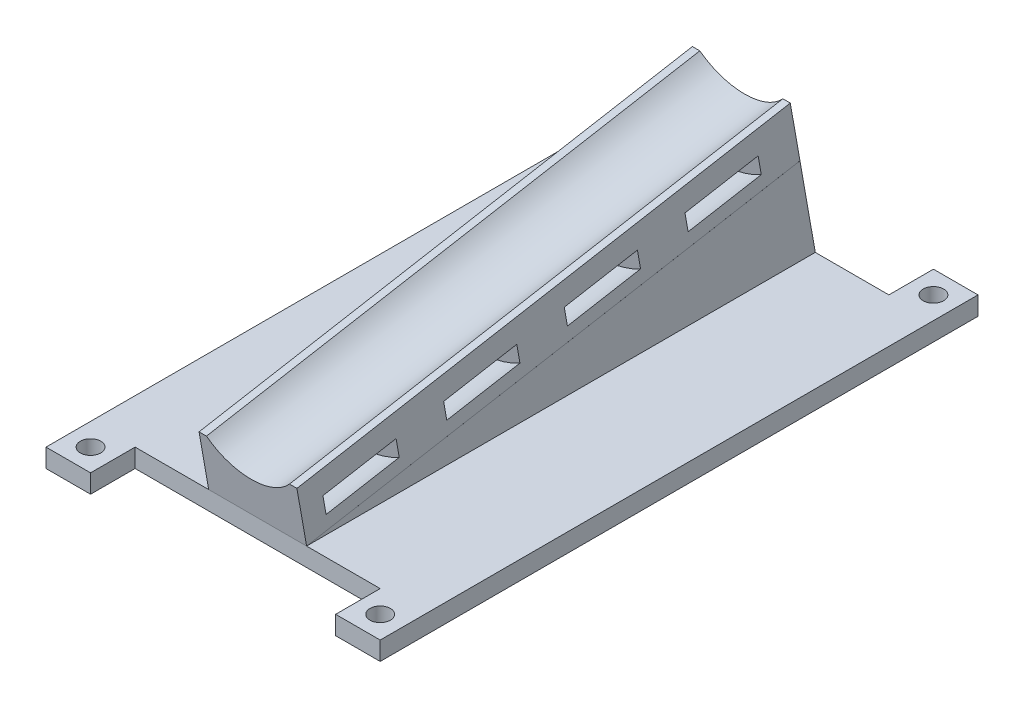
ISO-10303-21;
HEADER;
FILE_DESCRIPTION(('STEP AP214'),'2;1');
FILE_NAME('part.step','',(''),(''),'','','');
FILE_SCHEMA(('AUTOMOTIVE_DESIGN { 1 0 10303 214 1 1 1 1 }'));
ENDSEC;
DATA;
#1=APPLICATION_CONTEXT('core data for automotive mechanical design processes');
#2=APPLICATION_PROTOCOL_DEFINITION('international standard','automotive_design',2000,#1);
#3=PRODUCT_CONTEXT('',#1,'mechanical');
#4=PRODUCT('Part','Part','',(#3));
#5=PRODUCT_RELATED_PRODUCT_CATEGORY('part','',(#4));
#6=PRODUCT_DEFINITION_FORMATION('','',#4);
#7=PRODUCT_DEFINITION_CONTEXT('part definition',#1,'design');
#8=PRODUCT_DEFINITION('design','',#6,#7);
#9=PRODUCT_DEFINITION_SHAPE('','',#8);
#10=(LENGTH_UNIT() NAMED_UNIT(*) SI_UNIT(.MILLI.,.METRE.));
#11=(NAMED_UNIT(*) PLANE_ANGLE_UNIT() SI_UNIT($,.RADIAN.));
#12=(NAMED_UNIT(*) SI_UNIT($,.STERADIAN.) SOLID_ANGLE_UNIT());
#13=UNCERTAINTY_MEASURE_WITH_UNIT(LENGTH_MEASURE(1.E-05),#10,'distance_accuracy_value','');
#14=(GEOMETRIC_REPRESENTATION_CONTEXT(3) GLOBAL_UNCERTAINTY_ASSIGNED_CONTEXT((#13)) GLOBAL_UNIT_ASSIGNED_CONTEXT((#10,
#11,#12)) REPRESENTATION_CONTEXT('',''));
#15=CARTESIAN_POINT('',(0.,0.,0.));
#16=DIRECTION('',(0.,0.,1.));
#17=DIRECTION('',(1.,0.,0.));
#18=AXIS2_PLACEMENT_3D('',#15,#16,#17);
#19=CARTESIAN_POINT('',(58.1803398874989,28.4286121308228,-144.870262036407));
#20=DIRECTION('',(1.,0.,0.));
#21=DIRECTION('',(0.,0.,-1.));
#22=AXIS2_PLACEMENT_3D('',#19,#20,#21);
#23=PLANE('',#22);
#24=DIRECTION('',(0.,0.984807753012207,0.173648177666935));
#25=VECTOR('',#24,1.);
#26=CARTESIAN_POINT('',(58.1803398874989,5.,-12.));
#27=LINE('',#26,#25);
#28=CARTESIAN_POINT('',(58.1803398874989,5.,-12.));
#29=VERTEX_POINT('',#28);
#30=CARTESIAN_POINT('',(58.1803398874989,19.7721162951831,-9.39527733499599));
#31=VERTEX_POINT('',#30);
#32=EDGE_CURVE('E541',#29,#31,#27,.T.);
#33=ORIENTED_EDGE('',*,*,#32,.F.);
#34=DIRECTION('',(0.,-0.173648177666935,0.984807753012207));
#35=VECTOR('',#34,1.);
#36=CARTESIAN_POINT('',(58.1803398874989,28.4286121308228,-144.870262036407));
#37=LINE('',#36,#35);
#38=CARTESIAN_POINT('',(58.1803398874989,28.4286121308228,-144.870262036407));
#39=VERTEX_POINT('',#38);
#40=EDGE_CURVE('E744',#39,#29,#37,.T.);
#41=ORIENTED_EDGE('',*,*,#40,.F.);
#42=DIRECTION('',(0.,0.984807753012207,0.173648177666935));
#43=VECTOR('',#42,1.);
#44=CARTESIAN_POINT('',(58.1803398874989,28.4286121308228,-144.870262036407));
#45=LINE('',#44,#43);
#46=CARTESIAN_POINT('',(58.1803398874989,43.2007284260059,-142.265539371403));
#47=VERTEX_POINT('',#46);
#48=EDGE_CURVE('E785',#39,#47,#45,.T.);
#49=ORIENTED_EDGE('',*,*,#48,.T.);
#50=DIRECTION('',(0.,-0.173648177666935,0.984807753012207));
#51=VECTOR('',#50,1.);
#52=CARTESIAN_POINT('',(58.1803398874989,43.2007284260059,-142.265539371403));
#53=LINE('',#52,#51);
#54=EDGE_CURVE('E759',#47,#31,#53,.T.);
#55=ORIENTED_EDGE('',*,*,#54,.T.);
#56=EDGE_LOOP('',(#33,#41,#49,#55));
#57=FACE_BOUND('',#56,.T.);
#58=CARTESIAN_POINT('',(58.1803398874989,21.5510625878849,-84.2595625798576));
#59=CARTESIAN_POINT('',(58.1803398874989,18.6576788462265,-67.8441361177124));
#60=CARTESIAN_POINT('',(58.1803398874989,15.7642951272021,-51.4287096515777));
#61=CARTESIAN_POINT('',(58.1803398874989,8.62467093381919,-10.9225105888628));
#62=CARTESIAN_POINT('',(58.1803398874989,4.37843048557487,13.1682620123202));
#63=CARTESIAN_POINT('',(58.1803398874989,0.132190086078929,37.2590346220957));
#64=B_SPLINE_CURVE_WITH_KNOTS('',3,(#58,#59,#60,#61,#62,#63),.UNSPECIFIED.,.F.,.F.,(4,2,4),(0.,
50.0054102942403,123.391805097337),.UNSPECIFIED.);
#65=CARTESIAN_POINT('',(58.1803398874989,13.2127978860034,-36.9529540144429));
#66=VERTEX_POINT('',#65);
#67=CARTESIAN_POINT('',(58.1803398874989,9.74111311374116,-17.2565735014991));
#68=VERTEX_POINT('',#67);
#69=EDGE_CURVE('E547',#66,#68,#64,.T.);
#70=ORIENTED_EDGE('',*,*,#69,.T.);
#71=CARTESIAN_POINT('',(58.1803398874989,-32.0806175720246,-24.6286288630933));
#72=CARTESIAN_POINT('',(58.1803398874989,-26.8520415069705,-23.7069802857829));
#73=CARTESIAN_POINT('',(58.1803398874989,-21.6234654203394,-22.7853318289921));
#74=CARTESIAN_POINT('',(58.1803398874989,-11.1663145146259,-20.9420276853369));
#75=CARTESIAN_POINT('',(58.1803398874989,-5.93773969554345,-20.0203719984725));
#76=CARTESIAN_POINT('',(58.1803398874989,4.51940733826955,-18.1770459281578));
#77=CARTESIAN_POINT('',(58.1803398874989,9.74797955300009,-17.2553755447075));
#78=CARTESIAN_POINT('',(58.1803398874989,20.2051108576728,-15.4119603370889));
#79=CARTESIAN_POINT('',(58.1803398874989,25.4336699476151,-14.4902155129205));
#80=CARTESIAN_POINT('',(58.1803398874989,34.8839539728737,-12.8238736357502));
#81=CARTESIAN_POINT('',(58.1803398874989,39.1056903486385,-12.0793414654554));
#82=CARTESIAN_POINT('',(58.1803398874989,47.5491493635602,-10.5901992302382));
#83=CARTESIAN_POINT('',(58.1803398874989,51.7708720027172,-9.84558916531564));
#84=CARTESIAN_POINT('',(58.1803398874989,60.214314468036,-8.35635303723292));
#85=CARTESIAN_POINT('',(58.1803398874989,64.4360342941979,-7.6117269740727));
#86=CARTESIAN_POINT('',(58.1803398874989,72.8794724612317,-6.12246645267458));
#87=CARTESIAN_POINT('',(58.1803398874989,77.1011908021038,-5.3778319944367));
#88=CARTESIAN_POINT('',(58.1803398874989,81.3229090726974,-4.63319713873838));
#89=B_SPLINE_CURVE_WITH_KNOTS('',3,(#71,#72,#73,#74,#75,#76,#77,#78,#79,#80,#81,#82,#83,#84,#85,
#86,#87,#88),.UNSPECIFIED.,.F.,.F.,(4,2,2,2,2,2,2,2,4),(0.,15.9275545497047,31.8551091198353,
47.782663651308,63.7102181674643,76.5708742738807,89.4315303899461,102.292186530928,
115.152842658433),.UNSPECIFIED.);
#90=CARTESIAN_POINT('',(58.1803398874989,14.5614166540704,-16.4068480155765));
#91=VERTEX_POINT('',#90);
#92=EDGE_CURVE('E773',#68,#91,#89,.T.);
#93=ORIENTED_EDGE('',*,*,#92,.T.);
#94=CARTESIAN_POINT('',(58.1803398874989,5.87425261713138,32.8809325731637));
#95=CARTESIAN_POINT('',(58.1803398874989,8.30393472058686,19.0958077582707));
#96=CARTESIAN_POINT('',(58.1803398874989,10.7336168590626,5.3106829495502));
#97=CARTESIAN_POINT('',(58.1803398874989,17.3486571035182,-32.2206272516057));
#98=CARTESIAN_POINT('',(58.1803398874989,21.5340152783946,-55.9668126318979));
#99=CARTESIAN_POINT('',(58.1803398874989,25.7193735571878,-79.7129979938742));
#100=B_SPLINE_CURVE_WITH_KNOTS('',3,(#94,#95,#96,#97,#98,#99),.UNSPECIFIED.,.F.,.F.,(4,2,4),(0.,
41.9928230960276,114.329445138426),.UNSPECIFIED.);
#101=CARTESIAN_POINT('',(58.1803398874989,18.0329844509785,-36.1032491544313));
#102=VERTEX_POINT('',#101);
#103=EDGE_CURVE('E872',#91,#102,#100,.T.);
#104=ORIENTED_EDGE('',*,*,#103,.T.);
#105=CARTESIAN_POINT('',(58.1803398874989,77.9892350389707,-25.5299193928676));
#106=CARTESIAN_POINT('',(58.1803398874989,74.3347367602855,-26.1745081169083));
#107=CARTESIAN_POINT('',(58.1803398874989,70.6802375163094,-26.8190913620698));
#108=CARTESIAN_POINT('',(58.1803398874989,63.3712374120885,-28.1082487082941));
#109=CARTESIAN_POINT('',(58.1803398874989,59.7167365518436,-28.752822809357));
#110=CARTESIAN_POINT('',(58.1803398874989,48.7532320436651,-30.686534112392));
#111=CARTESIAN_POINT('',(58.1803398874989,41.4442264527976,-31.9756603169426));
#112=CARTESIAN_POINT('',(58.1803398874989,29.184345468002,-34.1373969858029));
#113=CARTESIAN_POINT('',(58.1803398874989,24.2335032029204,-35.0101953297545));
#114=CARTESIAN_POINT('',(58.1803398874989,14.3318043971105,-36.755711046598));
#115=CARTESIAN_POINT('',(58.1803398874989,9.3809478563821,-37.6284284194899));
#116=CARTESIAN_POINT('',(58.1803398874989,-0.520767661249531,-39.3738494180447));
#117=CARTESIAN_POINT('',(58.1803398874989,-5.47162663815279,-40.2465530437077));
#118=CARTESIAN_POINT('',(58.1803398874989,-15.3733459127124,-41.9919527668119));
#119=CARTESIAN_POINT('',(58.1803398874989,-20.3242062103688,-42.8646488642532));
#120=CARTESIAN_POINT('',(58.1803398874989,-25.2750666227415,-43.7373443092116));
#121=B_SPLINE_CURVE_WITH_KNOTS('',3,(#105,#106,#107,#108,#109,#110,#111,#112,#113,#114,#115,
#116,#117,#118,#119,#120),.UNSPECIFIED.,.F.,.F.,(4,2,2,2,2,2,2,4),(0.,11.1327297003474,
22.2654594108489,44.5309187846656,59.6124818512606,74.6940449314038,89.7756080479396,
104.857171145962),.UNSPECIFIED.);
#122=EDGE_CURVE('E866',#102,#66,#121,.T.);
#123=ORIENTED_EDGE('',*,*,#122,.T.);
#124=EDGE_LOOP('',(#70,#93,#104,#123));
#125=FACE_BOUND('',#124,.T.);
#126=CARTESIAN_POINT('',(58.1803398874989,26.5219889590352,-112.449451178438));
#127=CARTESIAN_POINT('',(58.1803398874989,23.6286331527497,-96.0341831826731));
#128=CARTESIAN_POINT('',(58.1803398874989,20.7352773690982,-79.6189151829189));
#129=CARTESIAN_POINT('',(58.1803398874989,14.0920388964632,-41.9289285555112));
#130=CARTESIAN_POINT('',(58.1803398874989,10.342156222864,-20.654209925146));
#131=CARTESIAN_POINT('',(58.1803398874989,6.59227358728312,0.620508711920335));
#132=B_SPLINE_CURVE_WITH_KNOTS('',3,(#126,#127,#128,#129,#130,#131),.UNSPECIFIED.,.F.,.F.,(4,2,
4),(0.,50.0049275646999,114.812932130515),.UNSPECIFIED.);
#133=CARTESIAN_POINT('',(58.1803398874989,18.9431877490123,-69.4516098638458));
#134=VERTEX_POINT('',#133);
#135=CARTESIAN_POINT('',(58.1803398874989,15.47150297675,-49.755229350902));
#136=VERTEX_POINT('',#135);
#137=EDGE_CURVE('E552',#134,#136,#132,.T.);
#138=ORIENTED_EDGE('',*,*,#137,.T.);
#139=CARTESIAN_POINT('',(58.1803398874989,-20.8342917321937,-56.1549830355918));
#140=CARTESIAN_POINT('',(58.1803398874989,-16.0653771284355,-55.3143588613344));
#141=CARTESIAN_POINT('',(58.1803398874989,-11.2964626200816,-54.4737341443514));
#142=CARTESIAN_POINT('',(58.1803398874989,-1.7586349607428,-52.7924769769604));
#143=CARTESIAN_POINT('',(58.1803398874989,3.01027819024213,-51.9518445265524));
#144=CARTESIAN_POINT('',(58.1803398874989,12.5481019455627,-50.2705652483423));
#145=CARTESIAN_POINT('',(58.1803398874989,17.3170125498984,-49.4299184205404));
#146=CARTESIAN_POINT('',(58.1803398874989,26.8548196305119,-47.7485446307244));
#147=CARTESIAN_POINT('',(58.1803398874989,31.6237161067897,-46.9078176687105));
#148=CARTESIAN_POINT('',(58.1803398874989,42.9616974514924,-44.9086324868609));
#149=CARTESIAN_POINT('',(58.1803398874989,49.5307584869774,-43.7500391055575));
#150=CARTESIAN_POINT('',(58.1803398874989,59.3843432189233,-42.0121103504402));
#151=CARTESIAN_POINT('',(58.1803398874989,62.6688703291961,-41.4327943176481));
#152=CARTESIAN_POINT('',(58.1803398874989,69.2379228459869,-40.274152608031));
#153=CARTESIAN_POINT('',(58.1803398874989,72.5224482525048,-39.694826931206));
#154=CARTESIAN_POINT('',(58.1803398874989,75.8069730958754,-39.1154980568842));
#155=B_SPLINE_CURVE_WITH_KNOTS('',3,(#139,#140,#141,#142,#143,#144,#145,#146,#147,#148,#149,
#150,#151,#152,#153,#154),.UNSPECIFIED.,.F.,.F.,(4,2,2,2,2,2,2,4),(0.,14.5273108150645,
29.0546216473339,43.5819324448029,58.1092432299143,78.1205928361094,88.1262676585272,
98.1319424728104),.UNSPECIFIED.);
#156=CARTESIAN_POINT('',(58.1803398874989,20.2918065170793,-48.9055038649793));
#157=VERTEX_POINT('',#156);
#158=EDGE_CURVE('E701',#136,#157,#155,.T.);
#159=ORIENTED_EDGE('',*,*,#158,.T.);
#160=CARTESIAN_POINT('',(58.1803398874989,12.3586031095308,-3.89541925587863));
#161=CARTESIAN_POINT('',(58.1803398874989,14.7883129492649,-17.6807013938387));
#162=CARTESIAN_POINT('',(58.1803398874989,17.2180228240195,-31.4659835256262));
#163=CARTESIAN_POINT('',(58.1803398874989,23.3304226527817,-66.1454964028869));
#164=CARTESIAN_POINT('',(58.1803398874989,27.0131126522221,-87.0397271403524));
#165=CARTESIAN_POINT('',(58.1803398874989,30.6958027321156,-107.933957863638));
#166=B_SPLINE_CURVE_WITH_KNOTS('',3,(#160,#161,#162,#163,#164,#165),.UNSPECIFIED.,.F.,.F.,(4,2,
4),(0.,41.9933023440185,105.642180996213),.UNSPECIFIED.);
#167=CARTESIAN_POINT('',(58.1803398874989,23.7633743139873,-68.6019050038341));
#168=VERTEX_POINT('',#167);
#169=EDGE_CURVE('E723',#157,#168,#166,.T.);
#170=ORIENTED_EDGE('',*,*,#169,.T.);
#171=CARTESIAN_POINT('',(58.1803398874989,72.4751671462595,-60.0118816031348));
#172=CARTESIAN_POINT('',(58.1803398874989,69.7577055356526,-60.4911864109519));
#173=CARTESIAN_POINT('',(58.1803398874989,67.0402437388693,-60.9704901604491));
#174=CARTESIAN_POINT('',(58.1803398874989,61.6053183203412,-61.9290873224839));
#175=CARTESIAN_POINT('',(58.1803398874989,58.8878546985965,-62.4083807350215));
#176=CARTESIAN_POINT('',(58.1803398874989,50.735458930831,-63.846233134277));
#177=CARTESIAN_POINT('',(58.1803398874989,45.3005218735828,-64.8047642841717));
#178=CARTESIAN_POINT('',(58.1803398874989,35.3742372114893,-66.5550336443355));
#179=CARTESIAN_POINT('',(58.1803398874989,30.8829008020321,-67.3468353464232));
#180=CARTESIAN_POINT('',(58.1803398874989,21.9002140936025,-68.930359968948));
#181=CARTESIAN_POINT('',(58.1803398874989,17.40886379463,-69.722082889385));
#182=CARTESIAN_POINT('',(58.1803398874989,8.42616048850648,-71.3055134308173));
#183=CARTESIAN_POINT('',(58.1803398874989,3.93480748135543,-72.0972210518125));
#184=CARTESIAN_POINT('',(58.1803398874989,-5.04789994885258,-73.6806282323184));
#185=CARTESIAN_POINT('',(58.1803398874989,-9.53925437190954,-74.4723277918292));
#186=CARTESIAN_POINT('',(58.1803398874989,-14.0306088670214,-75.2640269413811));
#187=B_SPLINE_CURVE_WITH_KNOTS('',3,(#171,#172,#173,#174,#175,#176,#177,#178,#179,#180,#181,
#182,#183,#184,#185,#186),.UNSPECIFIED.,.F.,.F.,(4,2,2,2,2,2,2,4),(0.,8.27822301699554,
16.5564460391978,33.1128920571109,46.7946855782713,60.4764791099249,74.1582726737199,
87.8400662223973),.UNSPECIFIED.);
#188=EDGE_CURVE('E696',#168,#134,#187,.T.);
#189=ORIENTED_EDGE('',*,*,#188,.T.);
#190=EDGE_LOOP('',(#138,#159,#170,#189));
#191=FACE_BOUND('',#190,.T.);
#192=CARTESIAN_POINT('',(58.1803398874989,31.5367623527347,-140.888103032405));
#193=CARTESIAN_POINT('',(58.1803398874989,28.6434328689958,-124.47298435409));
#194=CARTESIAN_POINT('',(58.1803398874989,25.7501034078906,-108.057865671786));
#195=CARTESIAN_POINT('',(58.1803398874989,19.5839425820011,-73.0745483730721));
#196=CARTESIAN_POINT('',(58.1803398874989,16.3111112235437,-54.5063497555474));
#197=CARTESIAN_POINT('',(58.1803398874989,13.038279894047,-35.9381511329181));
#198=B_SPLINE_CURVE_WITH_KNOTS('',3,(#192,#193,#194,#195,#196,#197),.UNSPECIFIED.,.F.,.F.,(4,2,
4),(0.,50.0044727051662,106.567754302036),.UNSPECIFIED.);
#199=CARTESIAN_POINT('',(58.1803398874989,24.6735776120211,-101.950265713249));
#200=VERTEX_POINT('',#199);
#201=CARTESIAN_POINT('',(58.1803398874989,21.2018928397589,-82.2538852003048));
#202=VERTEX_POINT('',#201);
#203=EDGE_CURVE('E556',#200,#202,#198,.T.);
#204=ORIENTED_EDGE('',*,*,#203,.T.);
#205=CARTESIAN_POINT('',(58.1803398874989,-9.62336630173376,-87.6875758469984));
#206=CARTESIAN_POINT('',(58.1803398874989,-5.31116324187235,-86.9274555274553));
#207=CARTESIAN_POINT('',(58.1803398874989,-0.998960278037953,-86.1673346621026));
#208=CARTESIAN_POINT('',(58.1803398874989,7.62544419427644,-84.6470846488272));
#209=CARTESIAN_POINT('',(58.1803398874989,11.9376457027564,-83.8869555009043));
#210=CARTESIAN_POINT('',(58.1803398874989,20.5620459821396,-82.3666817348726));
#211=CARTESIAN_POINT('',(58.1803398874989,24.8742447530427,-81.6065371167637));
#212=CARTESIAN_POINT('',(58.1803398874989,33.4986282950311,-80.0861684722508));
#213=CARTESIAN_POINT('',(58.1803398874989,37.8108130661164,-79.3259444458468));
#214=CARTESIAN_POINT('',(58.1803398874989,46.8235825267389,-77.7367545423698));
#215=CARTESIAN_POINT('',(58.1803398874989,51.5241630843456,-76.9077652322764));
#216=CARTESIAN_POINT('',(58.1803398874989,60.9253057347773,-75.2496818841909));
#217=CARTESIAN_POINT('',(58.1803398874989,65.6258678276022,-74.4205878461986));
#218=CARTESIAN_POINT('',(58.1803398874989,70.3264375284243,-73.5915369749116));
#219=B_SPLINE_CURVE_WITH_KNOTS('',3,(#205,#206,#207,#208,#209,#210,#211,#212,#213,#214,#215,
#216,#217,#218),.UNSPECIFIED.,.F.,.F.,(4,2,2,2,2,2,4),(0.,13.1360535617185,26.272107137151,
39.40816068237,52.5442142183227,66.863576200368,81.1829381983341),.UNSPECIFIED.);
#220=CARTESIAN_POINT('',(58.1803398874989,26.0221963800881,-81.4041597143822));
#221=VERTEX_POINT('',#220);
#222=EDGE_CURVE('E558',#202,#221,#219,.T.);
#223=ORIENTED_EDGE('',*,*,#222,.T.);
#224=CARTESIAN_POINT('',(58.1803398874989,18.7685866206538,-40.2498401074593));
#225=CARTESIAN_POINT('',(58.1803398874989,21.1983214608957,-54.0352640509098));
#226=CARTESIAN_POINT('',(58.1803398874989,23.6280563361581,-67.8206879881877));
#227=CARTESIAN_POINT('',(58.1803398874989,29.2873937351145,-99.9296908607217));
#228=CARTESIAN_POINT('',(58.1803398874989,32.5169962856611,-118.253269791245));
#229=CARTESIAN_POINT('',(58.1803398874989,35.7465988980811,-136.576848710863));
#230=B_SPLINE_CURVE_WITH_KNOTS('',3,(#224,#225,#226,#227,#228,#229),.UNSPECIFIED.,.F.,.F.,(4,2,
4),(0.,41.9937343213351,97.8117860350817),.UNSPECIFIED.);
#231=CARTESIAN_POINT('',(58.1803398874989,29.4937641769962,-101.100560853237));
#232=VERTEX_POINT('',#231);
#233=EDGE_CURVE('E627',#221,#232,#230,.T.);
#234=ORIENTED_EDGE('',*,*,#233,.T.);
#235=CARTESIAN_POINT('',(58.1803398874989,67.0632536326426,-94.4757956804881));
#236=CARTESIAN_POINT('',(58.1803398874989,62.8822025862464,-95.2132393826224));
#237=CARTESIAN_POINT('',(58.1803398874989,58.7011483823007,-95.9506652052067));
#238=CARTESIAN_POINT('',(58.1803398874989,50.3390170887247,-97.4253870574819));
#239=CARTESIAN_POINT('',(58.1803398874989,46.1579399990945,-98.1626830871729));
#240=CARTESIAN_POINT('',(58.1803398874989,38.2381019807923,-99.5590580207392));
#241=CARTESIAN_POINT('',(58.1803398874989,34.4993450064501,-100.218159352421));
#242=CARTESIAN_POINT('',(58.1803398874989,27.0218242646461,-101.536323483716));
#243=CARTESIAN_POINT('',(58.1803398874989,23.2830604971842,-102.195386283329));
#244=CARTESIAN_POINT('',(58.1803398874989,15.8055302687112,-103.513496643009));
#245=CARTESIAN_POINT('',(58.1803398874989,12.0667638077,-104.172544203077));
#246=CARTESIAN_POINT('',(58.1803398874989,4.58922968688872,-105.490632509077));
#247=CARTESIAN_POINT('',(58.1803398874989,0.850462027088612,-106.149673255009));
#248=CARTESIAN_POINT('',(58.1803398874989,-2.88830549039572,-106.808714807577));
#249=B_SPLINE_CURVE_WITH_KNOTS('',3,(#235,#236,#237,#238,#239,#240,#241,#242,#243,#244,#245,
#246,#247,#248),.UNSPECIFIED.,.F.,.F.,(4,2,2,2,2,2,4),(0.,12.7367617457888,25.4735234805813,
36.8627492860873,48.2519750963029,59.6412009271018,71.0304267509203),.UNSPECIFIED.);
#250=EDGE_CURVE('E560',#232,#200,#249,.T.);
#251=ORIENTED_EDGE('',*,*,#250,.T.);
#252=EDGE_LOOP('',(#204,#223,#234,#251));
#253=FACE_BOUND('',#252,.T.);
#254=CARTESIAN_POINT('',(58.1803398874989,36.6351774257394,-169.801290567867));
#255=CARTESIAN_POINT('',(58.1803398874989,33.7418711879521,-153.386303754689));
#256=CARTESIAN_POINT('',(58.1803398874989,30.8485649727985,-136.971316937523));
#257=CARTESIAN_POINT('',(58.1803398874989,25.1037206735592,-104.378311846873));
#258=CARTESIAN_POINT('',(58.1803398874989,22.2521825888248,-88.2002935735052));
#259=CARTESIAN_POINT('',(58.1803398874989,19.4006445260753,-72.022275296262));
#260=B_SPLINE_CURVE_WITH_KNOTS('',3,(#254,#255,#256,#257,#258,#259),.UNSPECIFIED.,.F.,.F.,(4,2,
4),(0.,50.0040710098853,99.2862777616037),.UNSPECIFIED.);
#261=CARTESIAN_POINT('',(58.1803398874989,30.40396747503,-134.448921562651));
#262=VERTEX_POINT('',#261);
#263=CARTESIAN_POINT('',(58.1803398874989,26.9322827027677,-114.752541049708));
#264=VERTEX_POINT('',#263);
#265=EDGE_CURVE('E274',#262,#264,#260,.T.);
#266=ORIENTED_EDGE('',*,*,#265,.T.);
#267=CARTESIAN_POINT('',(58.1803398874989,1.45853268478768,-119.242910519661));
#268=CARTESIAN_POINT('',(58.1803398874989,5.32477709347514,-118.561402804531));
#269=CARTESIAN_POINT('',(58.1803398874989,9.19102030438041,-117.879888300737));
#270=CARTESIAN_POINT('',(58.1803398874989,16.9235051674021,-116.516850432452));
#271=CARTESIAN_POINT('',(58.1803398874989,20.7897468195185,-115.835327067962));
#272=CARTESIAN_POINT('',(58.1803398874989,32.3884706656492,-113.790750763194));
#273=CARTESIAN_POINT('',(58.1803398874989,40.1209517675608,-112.427691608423));
#274=CARTESIAN_POINT('',(58.1803398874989,50.7069729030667,-110.561081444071));
#275=CARTESIAN_POINT('',(58.1803398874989,53.5605709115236,-110.057859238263));
#276=CARTESIAN_POINT('',(58.1803398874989,59.2677560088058,-109.051352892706));
#277=CARTESIAN_POINT('',(58.1803398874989,62.1213430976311,-108.548068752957));
#278=CARTESIAN_POINT('',(58.1803398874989,64.9749284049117,-108.044774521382));
#279=B_SPLINE_CURVE_WITH_KNOTS('',3,(#267,#268,#269,#270,#271,#272,#273,#274,#275,#276,#277,
#278),.UNSPECIFIED.,.F.,.F.,(4,2,2,2,2,4),(0.,11.7775501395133,23.5551002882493,
47.1102005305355,55.8030877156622,64.4959749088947),.UNSPECIFIED.);
#280=CARTESIAN_POINT('',(58.1803398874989,31.752586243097,-113.902815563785));
#281=VERTEX_POINT('',#280);
#282=EDGE_CURVE('E268',#264,#281,#279,.T.);
#283=ORIENTED_EDGE('',*,*,#282,.T.);
#284=CARTESIAN_POINT('',(58.1803398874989,25.0767309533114,-76.026462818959));
#285=CARTESIAN_POINT('',(58.1803398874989,27.5064870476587,-89.8120073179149));
#286=CARTESIAN_POINT('',(58.1803398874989,29.9362431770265,-103.597551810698));
#287=CARTESIAN_POINT('',(58.1803398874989,35.2104109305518,-133.521243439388));
#288=CARTESIAN_POINT('',(58.1803398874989,38.0548225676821,-149.659390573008));
#289=CARTESIAN_POINT('',(58.1803398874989,40.8992342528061,-165.797537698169));
#290=B_SPLINE_CURVE_WITH_KNOTS('',3,(#284,#285,#286,#287,#288,#289),.UNSPECIFIED.,.F.,.F.,(4,2,
4),(0.,41.994101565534,91.1547996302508),.UNSPECIFIED.);
#291=CARTESIAN_POINT('',(58.1803398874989,35.224154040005,-133.59921670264));
#292=VERTEX_POINT('',#291);
#293=EDGE_CURVE('E254',#281,#292,#290,.T.);
#294=ORIENTED_EDGE('',*,*,#293,.T.);
#295=CARTESIAN_POINT('',(58.1803398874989,61.8426775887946,-128.905879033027));
#296=CARTESIAN_POINT('',(58.1803398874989,59.0584297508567,-129.396935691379));
#297=CARTESIAN_POINT('',(58.1803398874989,56.2741725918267,-129.887939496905));
#298=CARTESIAN_POINT('',(58.1803398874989,50.7056428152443,-130.869859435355));
#299=CARTESIAN_POINT('',(58.1803398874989,47.921370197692,-131.360775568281));
#300=CARTESIAN_POINT('',(58.1803398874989,38.9580459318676,-132.941051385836));
#301=CARTESIAN_POINT('',(58.1803398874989,32.7789701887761,-134.030274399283));
#302=CARTESIAN_POINT('',(58.1803398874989,23.5103557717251,-135.664104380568));
#303=CARTESIAN_POINT('',(58.1803398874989,20.4208174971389,-136.208713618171));
#304=CARTESIAN_POINT('',(58.1803398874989,14.2417399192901,-137.297926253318));
#305=CARTESIAN_POINT('',(58.1803398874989,11.1522006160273,-137.842529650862));
#306=CARTESIAN_POINT('',(58.1803398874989,8.06266041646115,-138.387127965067));
#307=B_SPLINE_CURVE_WITH_KNOTS('',3,(#295,#296,#297,#298,#299,#300,#301,#302,#303,#304,#305,
#306),.UNSPECIFIED.,.F.,.F.,(4,2,2,2,2,4),(0.,8.48165985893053,16.9633197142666,
35.7863496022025,45.1978645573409,54.6093795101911),.UNSPECIFIED.);
#308=EDGE_CURVE('E339',#292,#262,#307,.T.);
#309=ORIENTED_EDGE('',*,*,#308,.T.);
#310=EDGE_LOOP('',(#266,#283,#294,#309));
#311=FACE_BOUND('',#310,.T.);
#312=ADVANCED_FACE('F55',(#57,#125,#191,#253,#311),#23,.T.);
#313=CARTESIAN_POINT('',(31.8196601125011,28.4286121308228,-144.870262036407));
#314=DIRECTION('',(0.,-0.984807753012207,-0.173648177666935));
#315=DIRECTION('',(0.,0.173648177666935,-0.984807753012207));
#316=AXIS2_PLACEMENT_3D('',#313,#314,#315);
#317=PLANE('',#316);
#318=DIRECTION('',(1.,0.,0.));
#319=VECTOR('',#318,1.);
#320=CARTESIAN_POINT('',(31.8196601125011,5.,-12.));
#321=LINE('',#320,#319);
#322=CARTESIAN_POINT('',(31.8196601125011,5.,-12.));
#323=VERTEX_POINT('',#322);
#324=EDGE_CURVE('E752',#323,#29,#321,.T.);
#325=ORIENTED_EDGE('',*,*,#324,.F.);
#326=DIRECTION('',(0.,-0.173648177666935,0.984807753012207));
#327=VECTOR('',#326,1.);
#328=CARTESIAN_POINT('',(31.8196601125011,28.4286121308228,-144.870262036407));
#329=LINE('',#328,#327);
#330=CARTESIAN_POINT('',(31.8196601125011,28.4286121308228,-144.870262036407));
#331=VERTEX_POINT('',#330);
#332=EDGE_CURVE('E745',#331,#323,#329,.T.);
#333=ORIENTED_EDGE('',*,*,#332,.F.);
#334=DIRECTION('',(1.,0.,0.));
#335=VECTOR('',#334,1.);
#336=CARTESIAN_POINT('',(31.8196601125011,28.4286121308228,-144.870262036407));
#337=LINE('',#336,#335);
#338=EDGE_CURVE('E760',#331,#39,#337,.T.);
#339=ORIENTED_EDGE('',*,*,#338,.T.);
#340=ORIENTED_EDGE('',*,*,#40,.T.);
#341=EDGE_LOOP('',(#325,#333,#339,#340));
#342=FACE_BOUND('',#341,.T.);
#343=CARTESIAN_POINT('',(44.7288595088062,9.62780421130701,-38.245581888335));
#344=CARTESIAN_POINT('',(44.7389189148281,9.2822871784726,-36.2860574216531));
#345=CARTESIAN_POINT('',(44.7496077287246,8.93677092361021,-34.3265373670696));
#346=CARTESIAN_POINT('',(44.7726885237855,8.24574137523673,-30.4075140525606));
#347=CARTESIAN_POINT('',(44.7850804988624,7.90022808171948,-28.4480107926));
#348=CARTESIAN_POINT('',(44.8120120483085,7.20920300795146,-24.5290128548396));
#349=CARTESIAN_POINT('',(44.8265516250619,6.8636912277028,-22.5695181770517));
#350=CARTESIAN_POINT('',(44.8628530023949,6.17267823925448,-18.6505887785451));
#351=CARTESIAN_POINT('',(44.8846148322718,5.82717703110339,-16.6911540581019));
#352=CARTESIAN_POINT('',(44.9125250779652,5.48168684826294,-14.7317818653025));
#353=B_SPLINE_CURVE_WITH_KNOTS('',3,(#343,#344,#345,#346,#347,#348,#349,#350,#351,#352),
.UNSPECIFIED.,.F.,.F.,(4,2,2,2,4),(0.,5.96933326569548,11.9386451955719,17.9079637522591,
23.8773065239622),.UNSPECIFIED.);
#354=CARTESIAN_POINT('',(44.732188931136,9.51485261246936,-37.6050015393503));
#355=VERTEX_POINT('',#354);
#356=CARTESIAN_POINT('',(44.8713491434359,6.041889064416,-17.9088465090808));
#357=VERTEX_POINT('',#356);
#358=EDGE_CURVE('E903',#355,#357,#353,.T.);
#359=ORIENTED_EDGE('',*,*,#358,.T.);
#360=CARTESIAN_POINT('',(45.128650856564,6.04188906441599,-17.9088465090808));
#361=CARTESIAN_POINT('',(45.1179299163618,6.04188906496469,-17.9088465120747));
#362=CARTESIAN_POINT('',(45.1072089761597,6.04188906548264,-17.9088465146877));
#363=CARTESIAN_POINT('',(45.0857671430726,6.04188906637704,-17.908846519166));
#364=CARTESIAN_POINT('',(45.0750462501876,6.04188906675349,-17.9088465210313));
#365=CARTESIAN_POINT('',(45.0536044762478,6.04188906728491,-17.9088465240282));
#366=CARTESIAN_POINT('',(45.0428835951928,6.04188906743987,-17.9088465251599));
#367=CARTESIAN_POINT('',(45.0214418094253,6.04188906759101,-17.9088465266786));
#368=CARTESIAN_POINT('',(45.0107209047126,6.0418890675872,-17.9088465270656));
#369=CARTESIAN_POINT('',(44.9892790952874,6.04188906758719,-17.9088465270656));
#370=CARTESIAN_POINT('',(44.9785581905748,6.04188906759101,-17.9088465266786));
#371=CARTESIAN_POINT('',(44.9571164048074,6.04188906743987,-17.9088465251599));
#372=CARTESIAN_POINT('',(44.9463955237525,6.0418890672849,-17.9088465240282));
#373=CARTESIAN_POINT('',(44.9249537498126,6.04188906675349,-17.9088465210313));
#374=CARTESIAN_POINT('',(44.9142328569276,6.04188906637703,-17.908846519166));
#375=CARTESIAN_POINT('',(44.8927910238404,6.04188906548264,-17.9088465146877));
#376=CARTESIAN_POINT('',(44.8820700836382,6.04188906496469,-17.9088465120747));
#377=CARTESIAN_POINT('',(44.8713491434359,6.04188906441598,-17.9088465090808));
#378=B_SPLINE_CURVE_WITH_KNOTS('',3,(#360,#361,#362,#363,#364,#365,#366,#367,#368,#369,#370,
#371,#372,#373,#374,#375,#376,#377),.UNSPECIFIED.,.F.,.F.,(4,2,2,2,2,2,2,2,4),(0.,
0.0321628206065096,0.0643254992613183,0.0964881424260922,0.128650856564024,0.160813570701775,
0.192976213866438,0.225138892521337,0.25730171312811),.UNSPECIFIED.);
#379=CARTESIAN_POINT('',(45.128650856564,6.041889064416,-17.9088465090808));
#380=VERTEX_POINT('',#379);
#381=EDGE_CURVE('E837',#380,#357,#378,.T.);
#382=ORIENTED_EDGE('',*,*,#381,.F.);
#383=CARTESIAN_POINT('',(45.0874749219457,5.48168684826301,-14.7317818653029));
#384=CARTESIAN_POINT('',(45.1153851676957,5.82717703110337,-16.6911540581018));
#385=CARTESIAN_POINT('',(45.1371469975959,6.17267823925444,-18.6505887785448));
#386=CARTESIAN_POINT('',(45.173448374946,6.86369122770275,-22.5695181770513));
#387=CARTESIAN_POINT('',(45.1879879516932,7.20920300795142,-24.5290128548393));
#388=CARTESIAN_POINT('',(45.2149195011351,7.90022808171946,-28.4480107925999));
#389=CARTESIAN_POINT('',(45.2273114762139,8.24574137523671,-30.4075140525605));
#390=CARTESIAN_POINT('',(45.2503922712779,8.93677092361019,-34.3265373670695));
#391=CARTESIAN_POINT('',(45.2610810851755,9.28228717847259,-36.286057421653));
#392=CARTESIAN_POINT('',(45.2711404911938,9.62780421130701,-38.245581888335));
#393=B_SPLINE_CURVE_WITH_KNOTS('',3,(#383,#384,#385,#386,#387,#388,#389,#390,#391,#392),
.UNSPECIFIED.,.F.,.F.,(4,2,2,2,4),(0.,5.96934277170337,11.9386613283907,17.9079732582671,
23.8773065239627),.UNSPECIFIED.);
#394=CARTESIAN_POINT('',(45.267811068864,9.51485261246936,-37.6050015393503));
#395=VERTEX_POINT('',#394);
#396=EDGE_CURVE('E852',#380,#395,#393,.T.);
#397=ORIENTED_EDGE('',*,*,#396,.T.);
#398=CARTESIAN_POINT('',(45.267811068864,9.51485261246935,-37.6050015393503));
#399=DIRECTION('',(-1.,0.,0.));
#400=VECTOR('',#399,1.);
#401=LINE('',#398,#400);
#402=EDGE_CURVE('E847',#395,#355,#401,.T.);
#403=ORIENTED_EDGE('',*,*,#402,.T.);
#404=EDGE_LOOP('',(#359,#382,#397,#403));
#405=FACE_BOUND('',#404,.T.);
#406=CARTESIAN_POINT('',(44.7285015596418,15.3704206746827,-70.8135782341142));
#407=CARTESIAN_POINT('',(44.7382647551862,15.0358243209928,-68.9159880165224));
#408=CARTESIAN_POINT('',(44.7485697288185,14.7012285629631,-67.0184011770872));
#409=CARTESIAN_POINT('',(44.7707436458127,14.0320395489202,-63.2232416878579));
#410=CARTESIAN_POINT('',(44.7826125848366,13.6974462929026,-61.3256690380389));
#411=CARTESIAN_POINT('',(44.8083949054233,13.0282614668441,-57.5305333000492));
#412=CARTESIAN_POINT('',(44.8223082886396,12.6936698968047,-55.6329702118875));
#413=CARTESIAN_POINT('',(44.8559907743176,12.0244949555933,-51.8378905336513));
#414=CARTESIAN_POINT('',(44.8757598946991,11.6899115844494,-49.9403739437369));
#415=CARTESIAN_POINT('',(44.9003625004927,11.3553364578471,-48.0429041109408));
#416=B_SPLINE_CURVE_WITH_KNOTS('',3,(#406,#407,#408,#409,#410,#411,#412,#413,#414,#415),
.UNSPECIFIED.,.F.,.F.,(4,2,2,2,4),(0.,5.7806633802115,11.5613107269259,17.3419627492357,
23.1226324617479),.UNSPECIFIED.);
#417=CARTESIAN_POINT('',(44.732188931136,15.2452424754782,-70.1036573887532));
#418=VERTEX_POINT('',#417);
#419=CARTESIAN_POINT('',(44.8713491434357,11.7722789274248,-50.4075023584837));
#420=VERTEX_POINT('',#419);
#421=EDGE_CURVE('E660',#418,#420,#416,.T.);
#422=ORIENTED_EDGE('',*,*,#421,.T.);
#423=CARTESIAN_POINT('',(45.128650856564,11.7722789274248,-50.4075023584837));
#424=CARTESIAN_POINT('',(45.1179299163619,11.7722789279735,-50.4075023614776));
#425=CARTESIAN_POINT('',(45.1072089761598,11.7722789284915,-50.4075023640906));
#426=CARTESIAN_POINT('',(45.0857671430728,11.7722789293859,-50.4075023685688));
#427=CARTESIAN_POINT('',(45.0750462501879,11.7722789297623,-50.4075023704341));
#428=CARTESIAN_POINT('',(45.0536044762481,11.7722789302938,-50.4075023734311));
#429=CARTESIAN_POINT('',(45.0428835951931,11.7722789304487,-50.4075023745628));
#430=CARTESIAN_POINT('',(45.0214418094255,11.7722789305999,-50.4075023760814));
#431=CARTESIAN_POINT('',(45.0107209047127,11.772278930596,-50.4075023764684));
#432=CARTESIAN_POINT('',(44.9892790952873,11.772278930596,-50.4075023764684));
#433=CARTESIAN_POINT('',(44.9785581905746,11.7722789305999,-50.4075023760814));
#434=CARTESIAN_POINT('',(44.9571164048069,11.7722789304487,-50.4075023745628));
#435=CARTESIAN_POINT('',(44.946395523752,11.7722789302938,-50.4075023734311));
#436=CARTESIAN_POINT('',(44.924953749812,11.7722789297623,-50.4075023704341));
#437=CARTESIAN_POINT('',(44.9142328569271,11.7722789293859,-50.4075023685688));
#438=CARTESIAN_POINT('',(44.89279102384,11.7722789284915,-50.4075023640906));
#439=CARTESIAN_POINT('',(44.8820700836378,11.7722789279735,-50.4075023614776));
#440=CARTESIAN_POINT('',(44.8713491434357,11.7722789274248,-50.4075023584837));
#441=B_SPLINE_CURVE_WITH_KNOTS('',3,(#423,#424,#425,#426,#427,#428,#429,#430,#431,#432,#433,
#434,#435,#436,#437,#438,#439,#440),.UNSPECIFIED.,.F.,.F.,(4,2,2,2,2,2,2,2,4),(0.,
0.0321628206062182,0.0643254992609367,0.096488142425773,0.128650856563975,0.160813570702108,
0.192976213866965,0.225138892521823,0.257301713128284),.UNSPECIFIED.);
#442=CARTESIAN_POINT('',(45.128650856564,11.7722789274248,-50.4075023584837));
#443=VERTEX_POINT('',#442);
#444=EDGE_CURVE('E695',#443,#420,#441,.T.);
#445=ORIENTED_EDGE('',*,*,#444,.F.);
#446=CARTESIAN_POINT('',(45.0996374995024,11.3553364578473,-48.0429041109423));
#447=CARTESIAN_POINT('',(45.1242401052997,11.6899115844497,-49.9403739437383));
#448=CARTESIAN_POINT('',(45.1440092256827,12.0244949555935,-51.8378905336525));
#449=CARTESIAN_POINT('',(45.1776917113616,12.6936698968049,-55.6329702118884));
#450=CARTESIAN_POINT('',(45.1916050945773,13.0282614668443,-57.5305333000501));
#451=CARTESIAN_POINT('',(45.2173874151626,13.6974462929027,-61.3256690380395));
#452=CARTESIAN_POINT('',(45.2292563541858,14.0320395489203,-63.2232416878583));
#453=CARTESIAN_POINT('',(45.2514302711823,14.7012285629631,-67.0184011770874));
#454=CARTESIAN_POINT('',(45.2617352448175,15.0358243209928,-68.9159880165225));
#455=CARTESIAN_POINT('',(45.2714984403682,15.3704206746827,-70.8135782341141));
#456=B_SPLINE_CURVE_WITH_KNOTS('',3,(#446,#447,#448,#449,#450,#451,#452,#453,#454,#455),
.UNSPECIFIED.,.F.,.F.,(4,2,2,2,4),(0.,5.78066971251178,11.5613217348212,17.3419690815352,
23.1226324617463),.UNSPECIFIED.);
#457=CARTESIAN_POINT('',(45.267811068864,15.2452424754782,-70.1036573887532));
#458=VERTEX_POINT('',#457);
#459=EDGE_CURVE('E658',#443,#458,#456,.T.);
#460=ORIENTED_EDGE('',*,*,#459,.T.);
#461=CARTESIAN_POINT('',(45.267811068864,15.2452424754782,-70.1036573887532));
#462=DIRECTION('',(-1.,0.,0.));
#463=VECTOR('',#462,1.);
#464=LINE('',#461,#463);
#465=EDGE_CURVE('E710',#458,#418,#464,.T.);
#466=ORIENTED_EDGE('',*,*,#465,.T.);
#467=EDGE_LOOP('',(#422,#445,#460,#466));
#468=FACE_BOUND('',#467,.T.);
#469=CARTESIAN_POINT('',(44.7285015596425,21.1008105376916,-103.312234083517));
#470=CARTESIAN_POINT('',(44.7500677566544,20.4555024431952,-99.6525100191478));
#471=CARTESIAN_POINT('',(44.7686911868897,19.8101865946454,-95.9927419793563));
#472=CARTESIAN_POINT('',(44.8047644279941,18.8422235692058,-90.5031508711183));
#473=CARTESIAN_POINT('',(44.8181451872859,18.5195710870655,-88.6732977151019));
#474=CARTESIAN_POINT('',(44.8497114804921,17.8742726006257,-85.0136281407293));
#475=CARTESIAN_POINT('',(44.8678970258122,17.5516265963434,-83.1838117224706));
#476=CARTESIAN_POINT('',(44.8895309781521,17.2289860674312,-81.3540263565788));
#477=B_SPLINE_CURVE_WITH_KNOTS('',3,(#469,#470,#471,#472,#473,#474,#475,#476),.UNSPECIFIED.,.F.,
.F.,(4,2,2,4),(0.,11.1487772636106,16.723163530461,22.2975630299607),.UNSPECIFIED.);
#478=CARTESIAN_POINT('',(44.7321889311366,20.9756323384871,-102.602313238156));
#479=VERTEX_POINT('',#478);
#480=CARTESIAN_POINT('',(44.8713491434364,17.5026687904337,-82.9061582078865));
#481=VERTEX_POINT('',#480);
#482=EDGE_CURVE('E566',#479,#481,#477,.T.);
#483=ORIENTED_EDGE('',*,*,#482,.T.);
#484=CARTESIAN_POINT('',(45.1286508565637,17.5026687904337,-82.9061582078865));
#485=CARTESIAN_POINT('',(45.1179299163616,17.5026687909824,-82.9061582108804));
#486=CARTESIAN_POINT('',(45.1072089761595,17.5026687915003,-82.9061582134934));
#487=CARTESIAN_POINT('',(45.0857671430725,17.5026687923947,-82.9061582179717));
#488=CARTESIAN_POINT('',(45.0750462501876,17.5026687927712,-82.906158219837));
#489=CARTESIAN_POINT('',(45.0536044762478,17.5026687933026,-82.9061582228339));
#490=CARTESIAN_POINT('',(45.0428835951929,17.5026687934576,-82.9061582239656));
#491=CARTESIAN_POINT('',(45.0214418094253,17.5026687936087,-82.9061582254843));
#492=CARTESIAN_POINT('',(45.0107209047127,17.5026687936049,-82.9061582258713));
#493=CARTESIAN_POINT('',(44.9892790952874,17.5026687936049,-82.9061582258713));
#494=CARTESIAN_POINT('',(44.9785581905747,17.5026687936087,-82.9061582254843));
#495=CARTESIAN_POINT('',(44.9571164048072,17.5026687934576,-82.9061582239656));
#496=CARTESIAN_POINT('',(44.9463955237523,17.5026687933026,-82.9061582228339));
#497=CARTESIAN_POINT('',(44.9249537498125,17.5026687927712,-82.906158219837));
#498=CARTESIAN_POINT('',(44.9142328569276,17.5026687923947,-82.9061582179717));
#499=CARTESIAN_POINT('',(44.8927910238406,17.5026687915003,-82.9061582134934));
#500=CARTESIAN_POINT('',(44.8820700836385,17.5026687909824,-82.9061582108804));
#501=CARTESIAN_POINT('',(44.8713491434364,17.5026687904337,-82.9061582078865));
#502=B_SPLINE_CURVE_WITH_KNOTS('',3,(#484,#485,#486,#487,#488,#489,#490,#491,#492,#493,#494,
#495,#496,#497,#498,#499,#500,#501),.UNSPECIFIED.,.F.,.F.,(4,2,2,2,2,2,2,2,4),(0.,
0.0321628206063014,0.0643254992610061,0.0964881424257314,0.128650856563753,0.160813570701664,
0.192976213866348,0.225138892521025,0.257301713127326),.UNSPECIFIED.);
#503=CARTESIAN_POINT('',(45.1286508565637,17.5026687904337,-82.9061582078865));
#504=VERTEX_POINT('',#503);
#505=EDGE_CURVE('E565',#504,#481,#502,.T.);
#506=ORIENTED_EDGE('',*,*,#505,.F.);
#507=CARTESIAN_POINT('',(45.1104690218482,17.2289860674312,-81.3540263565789));
#508=CARTESIAN_POINT('',(45.1321029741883,17.5516265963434,-83.1838117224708));
#509=CARTESIAN_POINT('',(45.1502885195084,17.8742726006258,-85.0136281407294));
#510=CARTESIAN_POINT('',(45.1818548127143,18.5195710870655,-88.673297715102));
#511=CARTESIAN_POINT('',(45.1952355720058,18.8422235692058,-90.5031508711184));
#512=CARTESIAN_POINT('',(45.2313088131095,19.8101865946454,-95.9927419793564));
#513=CARTESIAN_POINT('',(45.2499322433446,20.4555024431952,-99.6525100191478));
#514=CARTESIAN_POINT('',(45.2714984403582,21.1008105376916,-103.312234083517));
#515=B_SPLINE_CURVE_WITH_KNOTS('',3,(#507,#508,#509,#510,#511,#512,#513,#514),.UNSPECIFIED.,.F.,
.F.,(4,2,2,4),(0.,5.57439949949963,11.14878576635,22.2975630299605),.UNSPECIFIED.);
#516=CARTESIAN_POINT('',(45.2678110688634,20.9756323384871,-102.602313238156));
#517=VERTEX_POINT('',#516);
#518=EDGE_CURVE('E570',#504,#517,#515,.T.);
#519=ORIENTED_EDGE('',*,*,#518,.T.);
#520=CARTESIAN_POINT('',(45.2678110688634,20.9756323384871,-102.602313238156));
#521=DIRECTION('',(-1.,0.,0.));
#522=VECTOR('',#521,1.);
#523=LINE('',#520,#522);
#524=EDGE_CURVE('E1109',#517,#479,#523,.T.);
#525=ORIENTED_EDGE('',*,*,#524,.T.);
#526=EDGE_LOOP('',(#483,#506,#519,#525));
#527=FACE_BOUND('',#526,.T.);
#528=CARTESIAN_POINT('',(44.7285015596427,26.8312004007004,-135.81088993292));
#529=CARTESIAN_POINT('',(44.7443141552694,26.2097614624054,-132.286534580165));
#530=CARTESIAN_POINT('',(44.7648178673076,25.588328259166,-128.762211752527));
#531=CARTESIAN_POINT('',(44.8152075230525,24.3454733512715,-121.713631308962));
#532=CARTESIAN_POINT('',(44.8450934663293,23.7240516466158,-118.189373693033));
#533=CARTESIAN_POINT('',(44.8796705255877,23.1026356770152,-114.665148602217));
#534=B_SPLINE_CURVE_WITH_KNOTS('',3,(#528,#529,#530,#531,#532,#533),.UNSPECIFIED.,.F.,.F.,(4,2,
4),(0.,10.7362497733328,21.4724990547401),.UNSPECIFIED.);
#535=CARTESIAN_POINT('',(44.7321889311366,26.7060222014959,-135.100969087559));
#536=VERTEX_POINT('',#535);
#537=CARTESIAN_POINT('',(44.8713491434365,23.2330586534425,-115.404814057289));
#538=VERTEX_POINT('',#537);
#539=EDGE_CURVE('E487',#536,#538,#534,.T.);
#540=ORIENTED_EDGE('',*,*,#539,.T.);
#541=CARTESIAN_POINT('',(45.1286508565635,23.2330586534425,-115.404814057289));
#542=CARTESIAN_POINT('',(45.1179299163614,23.2330586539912,-115.404814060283));
#543=CARTESIAN_POINT('',(45.1072089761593,23.2330586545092,-115.404814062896));
#544=CARTESIAN_POINT('',(45.0857671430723,23.2330586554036,-115.404814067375));
#545=CARTESIAN_POINT('',(45.0750462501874,23.23305865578,-115.40481406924));
#546=CARTESIAN_POINT('',(45.0536044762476,23.2330586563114,-115.404814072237));
#547=CARTESIAN_POINT('',(45.0428835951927,23.2330586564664,-115.404814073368));
#548=CARTESIAN_POINT('',(45.0214418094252,23.2330586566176,-115.404814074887));
#549=CARTESIAN_POINT('',(45.0107209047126,23.2330586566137,-115.404814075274));
#550=CARTESIAN_POINT('',(44.9892790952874,23.2330586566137,-115.404814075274));
#551=CARTESIAN_POINT('',(44.9785581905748,23.2330586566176,-115.404814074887));
#552=CARTESIAN_POINT('',(44.9571164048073,23.2330586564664,-115.404814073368));
#553=CARTESIAN_POINT('',(44.9463955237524,23.2330586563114,-115.404814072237));
#554=CARTESIAN_POINT('',(44.9249537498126,23.23305865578,-115.40481406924));
#555=CARTESIAN_POINT('',(44.9142328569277,23.2330586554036,-115.404814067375));
#556=CARTESIAN_POINT('',(44.8927910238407,23.2330586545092,-115.404814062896));
#557=CARTESIAN_POINT('',(44.8820700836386,23.2330586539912,-115.404814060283));
#558=CARTESIAN_POINT('',(44.8713491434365,23.2330586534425,-115.404814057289));
#559=B_SPLINE_CURVE_WITH_KNOTS('',3,(#541,#542,#543,#544,#545,#546,#547,#548,#549,#550,#551,
#552,#553,#554,#555,#556,#557,#558),.UNSPECIFIED.,.F.,.F.,(4,2,2,2,2,2,2,2,4),(0.,
0.03216282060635,0.064325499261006,0.096488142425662,0.12865085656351,0.160813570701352,
0.192976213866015,0.225138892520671,0.257301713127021),.UNSPECIFIED.);
#560=CARTESIAN_POINT('',(45.1286508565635,23.2330586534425,-115.404814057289));
#561=VERTEX_POINT('',#560);
#562=EDGE_CURVE('E276',#561,#538,#559,.T.);
#563=ORIENTED_EDGE('',*,*,#562,.F.);
#564=CARTESIAN_POINT('',(45.120329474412,23.1026356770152,-114.665148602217));
#565=CARTESIAN_POINT('',(45.1549065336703,23.7240516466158,-118.189373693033));
#566=CARTESIAN_POINT('',(45.1847924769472,24.3454733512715,-121.713631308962));
#567=CARTESIAN_POINT('',(45.2351821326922,25.588328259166,-128.762211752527));
#568=CARTESIAN_POINT('',(45.2556858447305,26.2097614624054,-132.286534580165));
#569=CARTESIAN_POINT('',(45.2714984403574,26.8312004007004,-135.81088993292));
#570=B_SPLINE_CURVE_WITH_KNOTS('',3,(#564,#565,#566,#567,#568,#569),.UNSPECIFIED.,.F.,.F.,(4,2,
4),(0.,10.7362492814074,21.4724990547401),.UNSPECIFIED.);
#571=CARTESIAN_POINT('',(45.2678110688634,26.7060222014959,-135.100969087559));
#572=VERTEX_POINT('',#571);
#573=EDGE_CURVE('E493',#561,#572,#570,.T.);
#574=ORIENTED_EDGE('',*,*,#573,.T.);
#575=CARTESIAN_POINT('',(45.2678110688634,26.7060222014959,-135.100969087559));
#576=DIRECTION('',(-1.,0.,0.));
#577=VECTOR('',#576,1.);
#578=LINE('',#575,#577);
#579=EDGE_CURVE('E262',#572,#536,#578,.T.);
#580=ORIENTED_EDGE('',*,*,#579,.T.);
#581=EDGE_LOOP('',(#540,#563,#574,#580));
#582=FACE_BOUND('',#581,.T.);
#583=ADVANCED_FACE('F371',(#342,#405,#468,#527,#582),#317,.T.);
#584=CARTESIAN_POINT('',(31.8196601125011,43.2007284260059,-142.265539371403));
#585=DIRECTION('',(-1.,0.,0.));
#586=DIRECTION('',(0.,0.,1.));
#587=AXIS2_PLACEMENT_3D('',#584,#585,#586);
#588=PLANE('',#587);
#589=DIRECTION('',(0.,-0.984807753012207,-0.173648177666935));
#590=VECTOR('',#589,1.);
#591=CARTESIAN_POINT('',(31.8196601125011,19.7721162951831,-9.39527733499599));
#592=LINE('',#591,#590);
#593=CARTESIAN_POINT('',(31.8196601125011,19.7721162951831,-9.39527733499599));
#594=VERTEX_POINT('',#593);
#595=EDGE_CURVE('E781',#594,#323,#592,.T.);
#596=ORIENTED_EDGE('',*,*,#595,.F.);
#597=DIRECTION('',(0.,-0.173648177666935,0.984807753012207));
#598=VECTOR('',#597,1.);
#599=CARTESIAN_POINT('',(31.8196601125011,43.2007284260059,-142.265539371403));
#600=LINE('',#599,#598);
#601=CARTESIAN_POINT('',(31.8196601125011,43.2007284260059,-142.265539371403));
#602=VERTEX_POINT('',#601);
#603=EDGE_CURVE('E749',#602,#594,#600,.T.);
#604=ORIENTED_EDGE('',*,*,#603,.F.);
#605=DIRECTION('',(0.,-0.984807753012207,-0.173648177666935));
#606=VECTOR('',#605,1.);
#607=CARTESIAN_POINT('',(31.8196601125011,43.2007284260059,-142.265539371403));
#608=LINE('',#607,#606);
#609=EDGE_CURVE('E763',#602,#331,#608,.T.);
#610=ORIENTED_EDGE('',*,*,#609,.T.);
#611=ORIENTED_EDGE('',*,*,#332,.T.);
#612=EDGE_LOOP('',(#596,#604,#610,#611));
#613=FACE_BOUND('',#612,.T.);
#614=CARTESIAN_POINT('',(31.8196601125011,25.7193735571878,-79.7129979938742));
#615=CARTESIAN_POINT('',(31.8196601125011,23.2889614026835,-65.9237322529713));
#616=CARTESIAN_POINT('',(31.8196601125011,20.8585492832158,-52.1344665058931));
#617=CARTESIAN_POINT('',(31.8196601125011,14.2435089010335,-14.6031563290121));
#618=CARTESIAN_POINT('',(31.8196601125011,10.058880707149,9.13888811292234));
#619=CARTESIAN_POINT('',(31.8196601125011,5.87425261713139,32.8809325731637));
#620=B_SPLINE_CURVE_WITH_KNOTS('',3,(#614,#615,#616,#617,#618,#619),.UNSPECIFIED.,.F.,.F.,(4,2,
4),(0.,42.0054374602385,114.329445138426),.UNSPECIFIED.);
#621=CARTESIAN_POINT('',(31.8196601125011,18.0329844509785,-36.1032491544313));
#622=VERTEX_POINT('',#621);
#623=CARTESIAN_POINT('',(31.8196601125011,14.5614166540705,-16.4068480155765));
#624=VERTEX_POINT('',#623);
#625=EDGE_CURVE('E379',#622,#624,#620,.T.);
#626=ORIENTED_EDGE('',*,*,#625,.T.);
#627=CARTESIAN_POINT('',(31.8196601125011,81.3229090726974,-4.63319713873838));
#628=CARTESIAN_POINT('',(31.8196601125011,77.1011907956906,-5.37783199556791));
#629=CARTESIAN_POINT('',(31.8196601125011,72.8794724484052,-6.12246645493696));
#630=CARTESIAN_POINT('',(31.8196601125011,64.4360342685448,-7.61172697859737));
#631=CARTESIAN_POINT('',(31.8196601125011,60.2143144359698,-8.35635304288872));
#632=CARTESIAN_POINT('',(31.8196601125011,51.7708719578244,-9.84558917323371));
#633=CARTESIAN_POINT('',(31.8196601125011,47.5491493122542,-10.5901992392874));
#634=CARTESIAN_POINT('',(31.8196601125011,39.1056902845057,-12.0793414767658));
#635=CARTESIAN_POINT('',(31.8196601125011,34.8839539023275,-12.8238736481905));
#636=CARTESIAN_POINT('',(31.8196601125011,25.4336698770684,-14.4902155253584));
#637=CARTESIAN_POINT('',(31.8196601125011,20.2051107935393,-15.4119603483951));
#638=CARTESIAN_POINT('',(31.8196601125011,9.74797950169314,-17.2553755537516));
#639=CARTESIAN_POINT('',(31.8196601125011,4.51940729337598,-18.1770459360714));
#640=CARTESIAN_POINT('',(31.8196601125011,-5.93773972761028,-20.0203720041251));
#641=CARTESIAN_POINT('',(31.8196601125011,-11.1663145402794,-20.9420276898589));
#642=CARTESIAN_POINT('',(31.8196601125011,-21.6234654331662,-22.7853318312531));
#643=CARTESIAN_POINT('',(31.8196601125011,-26.8520415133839,-23.7069802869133));
#644=CARTESIAN_POINT('',(31.8196601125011,-32.0806175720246,-24.6286288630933));
#645=B_SPLINE_CURVE_WITH_KNOTS('',3,(#627,#628,#629,#630,#631,#632,#633,#634,#635,#636,#637,
#638,#639,#640,#641,#642,#643,#644),.UNSPECIFIED.,.F.,.F.,(4,2,2,2,2,2,2,2,4),(0.,
12.8606561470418,25.7213123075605,38.5819684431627,51.4426245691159,67.3701790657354,
83.2977335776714,99.2252881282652,115.152842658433),.UNSPECIFIED.);
#646=CARTESIAN_POINT('',(31.8196601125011,9.74111311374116,-17.2565735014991));
#647=VERTEX_POINT('',#646);
#648=EDGE_CURVE('E405',#624,#647,#645,.T.);
#649=ORIENTED_EDGE('',*,*,#648,.T.);
#650=CARTESIAN_POINT('',(31.8196601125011,0.132190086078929,37.2590346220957));
#651=CARTESIAN_POINT('',(31.8196601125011,3.02478597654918,20.8480773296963));
#652=CARTESIAN_POINT('',(31.8196601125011,5.91738188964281,4.4371200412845));
#653=CARTESIAN_POINT('',(31.8196601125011,13.0570060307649,-36.0690790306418));
#654=CARTESIAN_POINT('',(31.8196601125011,17.3040342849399,-60.1643208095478));
#655=CARTESIAN_POINT('',(31.8196601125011,21.5510625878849,-84.2595625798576));
#656=B_SPLINE_CURVE_WITH_KNOTS('',3,(#650,#651,#652,#653,#654,#655),.UNSPECIFIED.,.F.,.F.,(4,2,
4),(0.,49.9917960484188,123.391805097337),.UNSPECIFIED.);
#657=CARTESIAN_POINT('',(31.8196601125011,13.2127978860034,-36.9529540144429));
#658=VERTEX_POINT('',#657);
#659=EDGE_CURVE('E397',#647,#658,#656,.T.);
#660=ORIENTED_EDGE('',*,*,#659,.T.);
#661=CARTESIAN_POINT('',(31.8196601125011,-25.2750666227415,-43.7373443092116));
#662=CARTESIAN_POINT('',(31.8196601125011,-20.3242062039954,-42.8646488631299));
#663=CARTESIAN_POINT('',(31.8196601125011,-15.3733458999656,-41.9919527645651));
#664=CARTESIAN_POINT('',(31.8196601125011,-5.47162661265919,-40.2465530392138));
#665=CARTESIAN_POINT('',(31.8196601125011,-0.520767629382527,-39.3738494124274));
#666=CARTESIAN_POINT('',(31.8196601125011,9.38094790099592,-37.6284284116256));
#667=CARTESIAN_POINT('',(31.8196601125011,14.3318044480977,-36.7557110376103));
#668=CARTESIAN_POINT('',(31.8196601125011,24.2335032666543,-35.0101953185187));
#669=CARTESIAN_POINT('',(31.8196601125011,29.184345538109,-34.1373969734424));
#670=CARTESIAN_POINT('',(31.8196601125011,41.4442265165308,-31.9756603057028));
#671=CARTESIAN_POINT('',(31.8196601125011,48.7532320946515,-30.6865341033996));
#672=CARTESIAN_POINT('',(31.8196601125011,59.7167365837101,-28.7528228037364));
#673=CARTESIAN_POINT('',(31.8196601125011,63.3712374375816,-28.1082487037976));
#674=CARTESIAN_POINT('',(31.8196601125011,70.680237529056,-26.8190913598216));
#675=CARTESIAN_POINT('',(31.8196601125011,74.3347367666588,-26.1745081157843));
#676=CARTESIAN_POINT('',(31.8196601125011,77.9892350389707,-25.5299193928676));
#677=B_SPLINE_CURVE_WITH_KNOTS('',3,(#661,#662,#663,#664,#665,#666,#667,#668,#669,#670,#671,
#672,#673,#674,#675,#676),.UNSPECIFIED.,.F.,.F.,(4,2,2,2,2,2,2,4),(0.,15.0815631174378,
30.1631262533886,45.2446893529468,60.3262524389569,82.5917117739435,93.7244414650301,
104.857171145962),.UNSPECIFIED.);
#678=EDGE_CURVE('E389',#658,#622,#677,.T.);
#679=ORIENTED_EDGE('',*,*,#678,.T.);
#680=EDGE_LOOP('',(#626,#649,#660,#679));
#681=FACE_BOUND('',#680,.T.);
#682=CARTESIAN_POINT('',(31.8196601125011,30.6958027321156,-107.933957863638));
#683=CARTESIAN_POINT('',(31.8196601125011,28.2654183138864,-94.1448494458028));
#684=CARTESIAN_POINT('',(31.8196601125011,25.8350339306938,-80.3557410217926));
#685=CARTESIAN_POINT('',(31.8196601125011,19.7226340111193,-45.6762281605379));
#686=CARTESIAN_POINT('',(31.8196601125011,16.040618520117,-24.7858237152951));
#687=CARTESIAN_POINT('',(31.8196601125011,12.3586031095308,-3.89541925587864));
#688=B_SPLINE_CURVE_WITH_KNOTS('',3,(#682,#683,#684,#685,#686,#687),.UNSPECIFIED.,.F.,.F.,(4,2,
4),(0.,42.0049582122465,105.642180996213),.UNSPECIFIED.);
#689=CARTESIAN_POINT('',(31.8196601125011,23.7633743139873,-68.6019050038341));
#690=VERTEX_POINT('',#689);
#691=CARTESIAN_POINT('',(31.8196601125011,20.2918065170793,-48.9055038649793));
#692=VERTEX_POINT('',#691);
#693=EDGE_CURVE('E414',#690,#692,#688,.T.);
#694=ORIENTED_EDGE('',*,*,#693,.T.);
#695=CARTESIAN_POINT('',(31.8196601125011,75.8069730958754,-39.1154980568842));
#696=CARTESIAN_POINT('',(31.8196601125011,72.522448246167,-39.6948269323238));
#697=CARTESIAN_POINT('',(31.8196601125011,69.2379228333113,-40.2741526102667));
#698=CARTESIAN_POINT('',(31.8196601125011,62.668870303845,-41.4327943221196));
#699=CARTESIAN_POINT('',(31.8196601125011,59.3843431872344,-42.0121103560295));
#700=CARTESIAN_POINT('',(31.8196601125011,49.530758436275,-43.7500391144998));
#701=CARTESIAN_POINT('',(31.8196601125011,42.9616973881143,-44.9086324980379));
#702=CARTESIAN_POINT('',(31.8196601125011,31.6237160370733,-46.9078176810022));
#703=CARTESIAN_POINT('',(31.8196601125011,26.8548195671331,-47.7485446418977));
#704=CARTESIAN_POINT('',(31.8196601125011,17.3170124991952,-49.429918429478));
#705=CARTESIAN_POINT('',(31.8196601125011,12.5481019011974,-50.2705652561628));
#706=CARTESIAN_POINT('',(31.8196601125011,3.01027815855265,-51.9518445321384));
#707=CARTESIAN_POINT('',(31.8196601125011,-1.75863498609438,-52.7924769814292));
#708=CARTESIAN_POINT('',(31.8196601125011,-11.2964626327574,-54.4737341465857));
#709=CARTESIAN_POINT('',(31.8196601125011,-16.0653771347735,-55.3143588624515));
#710=CARTESIAN_POINT('',(31.8196601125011,-20.8342917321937,-56.1549830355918));
#711=B_SPLINE_CURVE_WITH_KNOTS('',3,(#695,#696,#697,#698,#699,#700,#701,#702,#703,#704,#705,
#706,#707,#708,#709,#710),.UNSPECIFIED.,.F.,.F.,(4,2,2,2,2,2,2,4),(0.,10.00567483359,
20.0113496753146,40.0226993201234,54.5500100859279,69.0773208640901,83.6046316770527,
98.1319424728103),.UNSPECIFIED.);
#712=CARTESIAN_POINT('',(31.8196601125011,15.47150297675,-49.755229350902));
#713=VERTEX_POINT('',#712);
#714=EDGE_CURVE('E439',#692,#713,#711,.T.);
#715=ORIENTED_EDGE('',*,*,#714,.T.);
#716=CARTESIAN_POINT('',(31.8196601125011,6.59227358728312,0.620508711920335));
#717=CARTESIAN_POINT('',(31.8196601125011,9.48489631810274,-15.7906008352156));
#718=CARTESIAN_POINT('',(31.8196601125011,12.3775190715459,-32.201710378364));
#719=CARTESIAN_POINT('',(31.8196601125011,19.0207575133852,-69.8916970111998));
#720=CARTESIAN_POINT('',(31.8196601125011,22.7713732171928,-91.1705740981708));
#721=CARTESIAN_POINT('',(31.8196601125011,26.5219889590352,-112.449451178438));
#722=B_SPLINE_CURVE_WITH_KNOTS('',3,(#716,#717,#718,#719,#720,#721),.UNSPECIFIED.,.F.,.F.,(4,2,
4),(0.,49.9922598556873,114.812932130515),.UNSPECIFIED.);
#723=CARTESIAN_POINT('',(31.8196601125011,18.9431877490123,-69.4516098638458));
#724=VERTEX_POINT('',#723);
#725=EDGE_CURVE('E431',#713,#724,#722,.T.);
#726=ORIENTED_EDGE('',*,*,#725,.T.);
#727=CARTESIAN_POINT('',(31.8196601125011,-14.0306088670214,-75.2640269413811));
#728=CARTESIAN_POINT('',(31.8196601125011,-9.53925436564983,-74.4723277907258));
#729=CARTESIAN_POINT('',(31.8196601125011,-5.04789993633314,-73.6806282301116));
#730=CARTESIAN_POINT('',(31.8196601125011,3.93480750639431,-72.0972210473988));
#731=CARTESIAN_POINT('',(31.8196601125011,8.42616051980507,-71.3055134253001));
#732=CARTESIAN_POINT('',(31.8196601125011,17.408863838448,-69.722082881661));
#733=CARTESIAN_POINT('',(31.8196601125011,21.9002141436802,-68.9303599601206));
#734=CARTESIAN_POINT('',(31.8196601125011,30.8829008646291,-67.3468353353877));
#735=CARTESIAN_POINT('',(31.8196601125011,35.3742372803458,-66.5550336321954));
#736=CARTESIAN_POINT('',(31.8196601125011,45.3005219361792,-64.8047642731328));
#737=CARTESIAN_POINT('',(31.8196601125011,50.735458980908,-63.8462331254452));
#738=CARTESIAN_POINT('',(31.8196601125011,58.8878547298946,-62.4083807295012));
#739=CARTESIAN_POINT('',(31.8196601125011,61.6053183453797,-61.9290873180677));
#740=CARTESIAN_POINT('',(31.8196601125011,67.0402437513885,-60.970490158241));
#741=CARTESIAN_POINT('',(31.8196601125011,69.7577055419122,-60.4911864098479));
#742=CARTESIAN_POINT('',(31.8196601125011,72.4751671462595,-60.0118816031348));
#743=B_SPLINE_CURVE_WITH_KNOTS('',3,(#727,#728,#729,#730,#731,#732,#733,#734,#735,#736,#737,
#738,#739,#740,#741,#742),.UNSPECIFIED.,.F.,.F.,(4,2,2,2,2,2,2,4),(0.,13.681793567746,
27.3635871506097,41.0453807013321,54.7271742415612,71.2836202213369,79.5618432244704,
87.8400662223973),.UNSPECIFIED.);
#744=EDGE_CURVE('E423',#724,#690,#743,.T.);
#745=ORIENTED_EDGE('',*,*,#744,.T.);
#746=EDGE_LOOP('',(#694,#715,#726,#745));
#747=FACE_BOUND('',#746,.T.);
#748=CARTESIAN_POINT('',(31.8196601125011,35.7465988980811,-136.576848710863));
#749=CARTESIAN_POINT('',(31.8196601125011,33.316239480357,-122.787882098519));
#750=CARTESIAN_POINT('',(31.8196601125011,30.8858800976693,-108.99891548));
#751=CARTESIAN_POINT('',(31.8196601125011,25.226542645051,-76.8899126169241));
#752=CARTESIAN_POINT('',(31.8196601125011,21.9975646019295,-58.569876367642));
#753=CARTESIAN_POINT('',(31.8196601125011,18.7685866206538,-40.2498401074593));
#754=B_SPLINE_CURVE_WITH_KNOTS('',3,(#748,#749,#750,#751,#752,#753),.UNSPECIFIED.,.F.,.F.,(4,2,
4),(0.,42.0045262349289,97.8117860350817),.UNSPECIFIED.);
#755=CARTESIAN_POINT('',(31.8196601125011,29.4937641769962,-101.100560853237));
#756=VERTEX_POINT('',#755);
#757=CARTESIAN_POINT('',(31.8196601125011,26.0221963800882,-81.4041597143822));
#758=VERTEX_POINT('',#757);
#759=EDGE_CURVE('E448',#756,#758,#754,.T.);
#760=ORIENTED_EDGE('',*,*,#759,.T.);
#761=CARTESIAN_POINT('',(31.8196601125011,70.3264375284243,-73.5915369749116));
#762=CARTESIAN_POINT('',(31.8196601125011,65.1519483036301,-74.5041899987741));
#763=CARTESIAN_POINT('',(31.8196601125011,59.9774639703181,-75.4168707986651));
#764=CARTESIAN_POINT('',(31.8196601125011,49.6284692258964,-77.2420844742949));
#765=CARTESIAN_POINT('',(31.8196601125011,44.4539588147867,-78.154617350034));
#766=CARTESIAN_POINT('',(31.8196601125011,35.2042106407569,-79.7855008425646));
#767=CARTESIAN_POINT('',(31.8196601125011,31.1289846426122,-80.5039181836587));
#768=CARTESIAN_POINT('',(31.8196601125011,22.9785247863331,-81.9407082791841));
#769=CARTESIAN_POINT('',(31.8196601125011,18.9032909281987,-82.6590810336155));
#770=CARTESIAN_POINT('',(31.8196601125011,10.7528204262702,-84.0958107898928));
#771=CARTESIAN_POINT('',(31.8196601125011,6.67758378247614,-84.8141677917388));
#772=CARTESIAN_POINT('',(31.8196601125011,-1.47289072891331,-86.250874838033));
#773=CARTESIAN_POINT('',(31.8196601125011,-5.5481285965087,-86.9692248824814));
#774=CARTESIAN_POINT('',(31.8196601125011,-9.62336630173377,-87.6875758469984));
#775=B_SPLINE_CURVE_WITH_KNOTS('',3,(#761,#762,#763,#764,#765,#766,#767,#768,#769,#770,#771,
#772,#773,#774),.UNSPECIFIED.,.F.,.F.,(4,2,2,2,2,2,4),(0.,15.7630729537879,31.5261458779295,
43.9403439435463,56.3545420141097,68.7687401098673,81.1829381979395),.UNSPECIFIED.);
#776=CARTESIAN_POINT('',(31.8196601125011,21.2018928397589,-82.2538852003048));
#777=VERTEX_POINT('',#776);
#778=EDGE_CURVE('E358',#758,#777,#775,.T.);
#779=ORIENTED_EDGE('',*,*,#778,.T.);
#780=CARTESIAN_POINT('',(31.8196601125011,13.038279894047,-35.9381511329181));
#781=CARTESIAN_POINT('',(31.8196601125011,15.9309289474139,-52.3494099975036));
#782=CARTESIAN_POINT('',(31.8196601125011,18.8235780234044,-68.7606688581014));
#783=CARTESIAN_POINT('',(31.8196601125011,24.9897388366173,-103.74398615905));
#784=CARTESIAN_POINT('',(31.8196601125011,28.2632505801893,-122.316044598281));
#785=CARTESIAN_POINT('',(31.8196601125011,31.5367623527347,-140.888103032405));
#786=B_SPLINE_CURVE_WITH_KNOTS('',3,(#780,#781,#782,#783,#784,#785),.UNSPECIFIED.,.F.,.F.,(4,2,
4),(0.,49.9927147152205,106.567754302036),.UNSPECIFIED.);
#787=CARTESIAN_POINT('',(31.8196601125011,24.6735776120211,-101.950265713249));
#788=VERTEX_POINT('',#787);
#789=EDGE_CURVE('E463',#777,#788,#786,.T.);
#790=ORIENTED_EDGE('',*,*,#789,.T.);
#791=CARTESIAN_POINT('',(31.8196601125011,-2.88830549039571,-106.808714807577));
#792=CARTESIAN_POINT('',(31.8196601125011,1.15205687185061,-106.096516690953));
#793=CARTESIAN_POINT('',(31.8196601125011,5.19241777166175,-105.384310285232));
#794=CARTESIAN_POINT('',(31.8196601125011,13.2731380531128,-103.959888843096));
#795=CARTESIAN_POINT('',(31.8196601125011,17.3134974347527,-103.247673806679));
#796=CARTESIAN_POINT('',(31.8196601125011,29.4345753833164,-101.111027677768));
#797=CARTESIAN_POINT('',(31.8196601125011,37.5152937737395,-99.686595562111));
#798=CARTESIAN_POINT('',(31.8196601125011,49.1738441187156,-97.6308660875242));
#799=CARTESIAN_POINT('',(31.8196601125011,52.7517345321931,-96.9999002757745));
#800=CARTESIAN_POINT('',(31.8196601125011,59.9075011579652,-95.7378881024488));
#801=CARTESIAN_POINT('',(31.8196601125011,63.4853773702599,-95.1068417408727));
#802=CARTESIAN_POINT('',(31.8196601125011,67.0632536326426,-94.4757956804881));
#803=B_SPLINE_CURVE_WITH_KNOTS('',3,(#791,#792,#793,#794,#795,#796,#797,#798,#799,#800,#801,
#802),.UNSPECIFIED.,.F.,.F.,(4,2,2,2,2,4),(0.,12.3079562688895,24.6159125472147,
49.2318250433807,60.1311258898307,71.0304267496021),.UNSPECIFIED.);
#804=EDGE_CURVE('E456',#788,#756,#803,.T.);
#805=ORIENTED_EDGE('',*,*,#804,.T.);
#806=EDGE_LOOP('',(#760,#779,#790,#805));
#807=FACE_BOUND('',#806,.T.);
#808=CARTESIAN_POINT('',(31.8196601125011,40.8992342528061,-165.797537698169));
#809=CARTESIAN_POINT('',(31.8196601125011,38.4688960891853,-152.008691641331));
#810=CARTESIAN_POINT('',(31.8196601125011,36.0385579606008,-138.219845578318));
#811=CARTESIAN_POINT('',(31.8196601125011,30.7643901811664,-108.296153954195));
#812=CARTESIAN_POINT('',(31.8196601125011,27.9205605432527,-92.1613083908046));
#813=CARTESIAN_POINT('',(31.8196601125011,25.0767309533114,-76.026462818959));
#814=B_SPLINE_CURVE_WITH_KNOTS('',3,(#808,#809,#810,#811,#812,#813),.UNSPECIFIED.,.F.,.F.,(4,2,
4),(0.,42.0041589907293,91.1547996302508),.UNSPECIFIED.);
#815=CARTESIAN_POINT('',(31.8196601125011,35.224154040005,-133.59921670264));
#816=VERTEX_POINT('',#815);
#817=CARTESIAN_POINT('',(31.8196601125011,31.752586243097,-113.902815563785));
#818=VERTEX_POINT('',#817);
#819=EDGE_CURVE('E350',#816,#818,#814,.T.);
#820=ORIENTED_EDGE('',*,*,#819,.T.);
#821=CARTESIAN_POINT('',(31.8196601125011,64.9749284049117,-108.044774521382));
#822=CARTESIAN_POINT('',(31.8196601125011,61.3940148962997,-108.676364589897));
#823=CARTESIAN_POINT('',(31.8196601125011,57.8130948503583,-109.307917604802));
#824=CARTESIAN_POINT('',(31.8196601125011,50.6512344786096,-110.570908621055));
#825=CARTESIAN_POINT('',(31.8196601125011,47.0702941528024,-111.202346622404));
#826=CARTESIAN_POINT('',(31.8196601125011,39.9867909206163,-112.451243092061));
#827=CARTESIAN_POINT('',(31.8196601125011,36.4842286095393,-113.068704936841));
#828=CARTESIAN_POINT('',(31.8196601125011,29.4790979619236,-114.303594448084));
#829=CARTESIAN_POINT('',(31.8196601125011,25.976529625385,-114.921022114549));
#830=CARTESIAN_POINT('',(31.8196601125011,18.9713904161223,-116.155863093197));
#831=CARTESIAN_POINT('',(31.8196601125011,15.4688195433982,-116.77327640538));
#832=CARTESIAN_POINT('',(31.8196601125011,8.4636766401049,-118.008096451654));
#833=CARTESIAN_POINT('',(31.8196601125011,4.96110460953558,-118.625503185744));
#834=CARTESIAN_POINT('',(31.8196601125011,1.45853268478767,-119.242910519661));
#835=B_SPLINE_CURVE_WITH_KNOTS('',3,(#821,#822,#823,#824,#825,#826,#827,#828,#829,#830,#831,
#832,#833,#834),.UNSPECIFIED.,.F.,.F.,(4,2,2,2,2,2,4),(0.,10.908557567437,21.8171151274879,
32.4868300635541,43.1565450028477,53.8262599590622,64.4959749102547),.UNSPECIFIED.);
#836=CARTESIAN_POINT('',(31.8196601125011,26.9322827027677,-114.752541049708));
#837=VERTEX_POINT('',#836);
#838=EDGE_CURVE('E12',#818,#837,#835,.T.);
#839=ORIENTED_EDGE('',*,*,#838,.T.);
#840=CARTESIAN_POINT('',(31.8196601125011,19.4006445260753,-72.022275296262));
#841=CARTESIAN_POINT('',(31.8196601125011,22.2933168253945,-88.4336660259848));
#842=CARTESIAN_POINT('',(31.8196601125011,25.1859891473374,-104.84505675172));
#843=CARTESIAN_POINT('',(31.8196601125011,30.9308334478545,-137.438061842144));
#844=CARTESIAN_POINT('',(31.8196601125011,33.7830054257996,-153.619676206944));
#845=CARTESIAN_POINT('',(31.8196601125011,36.6351774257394,-169.801290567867));
#846=B_SPLINE_CURVE_WITH_KNOTS('',3,(#840,#841,#842,#843,#844,#845),.UNSPECIFIED.,.F.,.F.,(4,2,
4),(0.,49.993116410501,99.2862777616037),.UNSPECIFIED.);
#847=CARTESIAN_POINT('',(31.8196601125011,30.40396747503,-134.448921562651));
#848=VERTEX_POINT('',#847);
#849=EDGE_CURVE('E66',#837,#848,#846,.T.);
#850=ORIENTED_EDGE('',*,*,#849,.T.);
#851=CARTESIAN_POINT('',(31.8196601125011,8.06266041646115,-138.387127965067));
#852=CARTESIAN_POINT('',(31.8196601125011,11.6679736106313,-137.751610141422));
#853=CARTESIAN_POINT('',(31.8196601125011,15.2732866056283,-137.116091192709));
#854=CARTESIAN_POINT('',(31.8196601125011,22.4839109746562,-135.845044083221));
#855=CARTESIAN_POINT('',(31.8196601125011,26.0892223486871,-135.209515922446));
#856=CARTESIAN_POINT('',(31.8196601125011,36.9051521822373,-133.302907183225));
#857=CARTESIAN_POINT('',(31.8196601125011,44.1157663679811,-132.03180234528));
#858=CARTESIAN_POINT('',(31.8196601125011,54.831792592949,-130.142309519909));
#859=CARTESIAN_POINT('',(31.8196601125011,58.3372437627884,-129.524143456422));
#860=CARTESIAN_POINT('',(31.8196601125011,61.8426775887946,-128.905879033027));
#861=B_SPLINE_CURVE_WITH_KNOTS('',3,(#851,#852,#853,#854,#855,#856,#857,#858,#859,#860),
.UNSPECIFIED.,.F.,.F.,(4,2,2,2,4),(0.,10.9826907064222,21.9653814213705,43.9307628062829,
54.6093795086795),.UNSPECIFIED.);
#862=EDGE_CURVE('E357',#848,#816,#861,.T.);
#863=ORIENTED_EDGE('',*,*,#862,.T.);
#864=EDGE_LOOP('',(#820,#839,#850,#863));
#865=FACE_BOUND('',#864,.T.);
#866=ADVANCED_FACE('F366',(#613,#681,#747,#807,#865),#588,.T.);
#867=CARTESIAN_POINT('',(33.8196601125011,43.2007284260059,-142.265539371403));
#868=DIRECTION('',(0.,0.984807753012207,0.173648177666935));
#869=DIRECTION('',(0.,-0.173648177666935,0.984807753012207));
#870=AXIS2_PLACEMENT_3D('',#867,#868,#869);
#871=PLANE('',#870);
#872=DIRECTION('',(-1.,0.,0.));
#873=VECTOR('',#872,1.);
#874=CARTESIAN_POINT('',(33.8196601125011,19.7721162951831,-9.39527733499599));
#875=LINE('',#874,#873);
#876=CARTESIAN_POINT('',(33.8196601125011,19.7721162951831,-9.39527733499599));
#877=VERTEX_POINT('',#876);
#878=EDGE_CURVE('E779',#877,#594,#875,.T.);
#879=ORIENTED_EDGE('',*,*,#878,.F.);
#880=DIRECTION('',(0.,-0.173648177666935,0.984807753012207));
#881=VECTOR('',#880,1.);
#882=CARTESIAN_POINT('',(33.8196601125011,43.2007284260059,-142.265539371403));
#883=LINE('',#882,#881);
#884=CARTESIAN_POINT('',(33.8196601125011,43.2007284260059,-142.265539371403));
#885=VERTEX_POINT('',#884);
#886=EDGE_CURVE('E756',#885,#877,#883,.T.);
#887=ORIENTED_EDGE('',*,*,#886,.F.);
#888=DIRECTION('',(-1.,0.,0.));
#889=VECTOR('',#888,1.);
#890=CARTESIAN_POINT('',(33.8196601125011,43.2007284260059,-142.265539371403));
#891=LINE('',#890,#889);
#892=EDGE_CURVE('E767',#885,#602,#891,.T.);
#893=ORIENTED_EDGE('',*,*,#892,.T.);
#894=ORIENTED_EDGE('',*,*,#603,.T.);
#895=EDGE_LOOP('',(#879,#887,#893,#894));
#896=FACE_BOUND('',#895,.T.);
#897=ADVANCED_FACE('F370',(#896),#871,.T.);
#898=CARTESIAN_POINT('',(45.,53.048805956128,-140.529057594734));
#899=DIRECTION('',(0.,-0.173648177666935,0.984807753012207));
#900=DIRECTION('',(0.,-0.984807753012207,-0.173648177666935));
#901=AXIS2_PLACEMENT_3D('',#898,#899,#900);
#902=CYLINDRICAL_SURFACE('',#901,15.);
#903=CARTESIAN_POINT('',(45.,29.6201938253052,-7.65879555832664));
#904=DIRECTION('',(0.,0.173648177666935,-0.984807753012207));
#905=DIRECTION('',(0.,-0.984807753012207,-0.173648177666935));
#906=AXIS2_PLACEMENT_3D('',#903,#904,#905);
#907=CIRCLE('',#906,15.);
#908=CARTESIAN_POINT('',(56.1803398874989,19.7721162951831,-9.39527733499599));
#909=VERTEX_POINT('',#908);
#910=EDGE_CURVE('E776',#909,#877,#907,.T.);
#911=ORIENTED_EDGE('',*,*,#910,.F.);
#912=DIRECTION('',(0.,-0.173648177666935,0.984807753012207));
#913=VECTOR('',#912,1.);
#914=CARTESIAN_POINT('',(56.1803398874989,43.2007284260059,-142.265539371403));
#915=LINE('',#914,#913);
#916=CARTESIAN_POINT('',(56.1803398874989,43.2007284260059,-142.265539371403));
#917=VERTEX_POINT('',#916);
#918=EDGE_CURVE('E758',#917,#909,#915,.T.);
#919=ORIENTED_EDGE('',*,*,#918,.F.);
#920=CARTESIAN_POINT('',(45.,53.048805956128,-140.529057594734));
#921=DIRECTION('',(0.,0.173648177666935,-0.984807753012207));
#922=DIRECTION('',(0.,-0.984807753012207,-0.173648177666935));
#923=AXIS2_PLACEMENT_3D('',#920,#921,#922);
#924=CIRCLE('',#923,15.);
#925=EDGE_CURVE('E790',#917,#885,#924,.T.);
#926=ORIENTED_EDGE('',*,*,#925,.T.);
#927=ORIENTED_EDGE('',*,*,#886,.T.);
#928=EDGE_LOOP('',(#911,#919,#926,#927));
#929=FACE_BOUND('',#928,.T.);
#930=ADVANCED_FACE('F809',(#929),#902,.F.);
#931=CARTESIAN_POINT('',(58.1803398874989,43.2007284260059,-142.265539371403));
#932=DIRECTION('',(0.,0.984807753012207,0.173648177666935));
#933=DIRECTION('',(0.,-0.173648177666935,0.984807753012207));
#934=AXIS2_PLACEMENT_3D('',#931,#932,#933);
#935=PLANE('',#934);
#936=DIRECTION('',(-1.,0.,0.));
#937=VECTOR('',#936,1.);
#938=CARTESIAN_POINT('',(58.1803398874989,19.7721162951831,-9.39527733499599));
#939=LINE('',#938,#937);
#940=EDGE_CURVE('E772',#31,#909,#939,.T.);
#941=ORIENTED_EDGE('',*,*,#940,.F.);
#942=ORIENTED_EDGE('',*,*,#54,.F.);
#943=DIRECTION('',(-1.,0.,0.));
#944=VECTOR('',#943,1.);
#945=CARTESIAN_POINT('',(58.1803398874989,43.2007284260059,-142.265539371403));
#946=LINE('',#945,#944);
#947=EDGE_CURVE('E786',#47,#917,#946,.T.);
#948=ORIENTED_EDGE('',*,*,#947,.T.);
#949=ORIENTED_EDGE('',*,*,#918,.T.);
#950=EDGE_LOOP('',(#941,#942,#948,#949));
#951=FACE_BOUND('',#950,.T.);
#952=ADVANCED_FACE('F811',(#951),#935,.T.);
#953=CARTESIAN_POINT('',(45.,53.048805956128,-140.529057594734));
#954=DIRECTION('',(0.,-0.173648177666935,0.984807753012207));
#955=DIRECTION('',(0.,-0.984807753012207,-0.173648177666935));
#956=AXIS2_PLACEMENT_3D('',#953,#954,#955);
#957=PLANE('',#956);
#958=ORIENTED_EDGE('',*,*,#48,.F.);
#959=ORIENTED_EDGE('',*,*,#338,.F.);
#960=ORIENTED_EDGE('',*,*,#609,.F.);
#961=ORIENTED_EDGE('',*,*,#892,.F.);
#962=ORIENTED_EDGE('',*,*,#925,.F.);
#963=ORIENTED_EDGE('',*,*,#947,.F.);
#964=EDGE_LOOP('',(#958,#959,#960,#961,#962,#963));
#965=FACE_BOUND('',#964,.T.);
#966=ADVANCED_FACE('F805',(#965),#957,.F.);
#967=CARTESIAN_POINT('',(45.,29.6201938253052,-7.65879555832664));
#968=DIRECTION('',(0.,-0.173648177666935,0.984807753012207));
#969=DIRECTION('',(0.,-0.984807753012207,-0.173648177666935));
#970=AXIS2_PLACEMENT_3D('',#967,#968,#969);
#971=PLANE('',#970);
#972=ORIENTED_EDGE('',*,*,#32,.T.);
#973=ORIENTED_EDGE('',*,*,#940,.T.);
#974=ORIENTED_EDGE('',*,*,#910,.T.);
#975=ORIENTED_EDGE('',*,*,#878,.T.);
#976=ORIENTED_EDGE('',*,*,#595,.T.);
#977=ORIENTED_EDGE('',*,*,#324,.T.);
#978=EDGE_LOOP('',(#972,#973,#974,#975,#976,#977));
#979=FACE_BOUND('',#978,.T.);
#980=ADVANCED_FACE('F812',(#979),#971,.T.);
#981=CARTESIAN_POINT('',(45.,30.6620828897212,-13.5676420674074));
#982=DIRECTION('',(0.,0.173648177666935,-0.984807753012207));
#983=DIRECTION('',(0.,0.984807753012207,0.173648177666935));
#984=AXIS2_PLACEMENT_3D('',#981,#982,#983);
#985=CONICAL_SURFACE('',#984,25.0003310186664,5.5169777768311E-05);
#986=CARTESIAN_POINT('',(45.,34.1350464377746,-33.263797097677));
#987=DIRECTION('',(0.,0.173648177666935,-0.984807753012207));
#988=DIRECTION('',(0.,0.984807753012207,0.173648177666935));
#989=AXIS2_PLACEMENT_3D('',#986,#987,#988);
#990=CIRCLE('',#989,25.0014344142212);
#991=EDGE_CURVE('E899',#355,#658,#990,.T.);
#992=ORIENTED_EDGE('',*,*,#991,.T.);
#993=ORIENTED_EDGE('',*,*,#659,.F.);
#994=CARTESIAN_POINT('',(45.,30.6620828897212,-13.5676420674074));
#995=DIRECTION('',(0.,0.173648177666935,-0.984807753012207));
#996=DIRECTION('',(0.,0.984807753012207,0.173648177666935));
#997=AXIS2_PLACEMENT_3D('',#994,#995,#996);
#998=CIRCLE('',#997,25.0003310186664);
#999=EDGE_CURVE('E883',#357,#647,#998,.T.);
#1000=ORIENTED_EDGE('',*,*,#999,.F.);
#1001=ORIENTED_EDGE('',*,*,#358,.F.);
#1002=EDGE_LOOP('',(#992,#993,#1000,#1001));
#1003=FACE_BOUND('',#1002,.T.);
#1004=ADVANCED_FACE('F814',(#1003),#985,.F.);
#1005=CARTESIAN_POINT('',(45.,30.6621212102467,-13.5678593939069));
#1006=DIRECTION('',(0.,-0.173648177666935,0.984807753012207));
#1007=DIRECTION('',(0.,-0.984807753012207,-0.173648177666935));
#1008=AXIS2_PLACEMENT_3D('',#1005,#1006,#1007);
#1009=CONICAL_SURFACE('',#1008,21.0003310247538,1.57074115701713);
#1010=EDGE_CURVE('E793',#68,#380,#998,.T.);
#1011=ORIENTED_EDGE('',*,*,#1010,.T.);
#1012=ORIENTED_EDGE('',*,*,#381,.T.);
#1013=ORIENTED_EDGE('',*,*,#999,.T.);
#1014=ORIENTED_EDGE('',*,*,#648,.F.);
#1015=CARTESIAN_POINT('',(45.,30.6621212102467,-13.5678593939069));
#1016=DIRECTION('',(0.,0.173648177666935,-0.984807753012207));
#1017=DIRECTION('',(0.,0.984807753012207,0.173648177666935));
#1018=AXIS2_PLACEMENT_3D('',#1015,#1016,#1017);
#1019=CIRCLE('',#1018,21.0003310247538);
#1020=EDGE_CURVE('E707',#91,#624,#1019,.T.);
#1021=ORIENTED_EDGE('',*,*,#1020,.F.);
#1022=ORIENTED_EDGE('',*,*,#92,.F.);
#1023=EDGE_LOOP('',(#1011,#1012,#1013,#1014,#1021,#1022));
#1024=FACE_BOUND('',#1023,.T.);
#1025=ADVANCED_FACE('F819',(#1024),#1009,.T.);
#1026=EDGE_CURVE('E885',#66,#395,#990,.T.);
#1027=ORIENTED_EDGE('',*,*,#1026,.T.);
#1028=ORIENTED_EDGE('',*,*,#396,.F.);
#1029=ORIENTED_EDGE('',*,*,#1010,.F.);
#1030=ORIENTED_EDGE('',*,*,#69,.F.);
#1031=EDGE_LOOP('',(#1027,#1028,#1029,#1030));
#1032=FACE_BOUND('',#1031,.T.);
#1033=ADVANCED_FACE('F821',(#1032),#985,.F.);
#1034=CARTESIAN_POINT('',(45.,34.1350464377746,-33.263797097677));
#1035=DIRECTION('',(0.,-0.173648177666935,0.984807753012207));
#1036=DIRECTION('',(0.,-0.984807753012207,-0.173648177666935));
#1037=AXIS2_PLACEMENT_3D('',#1034,#1035,#1036);
#1038=CONICAL_SURFACE('',#1037,25.0014344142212,1.57074115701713);
#1039=CARTESIAN_POINT('',(45.,34.1350847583,-33.2640144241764));
#1040=DIRECTION('',(0.,0.173648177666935,-0.984807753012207));
#1041=DIRECTION('',(0.,0.984807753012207,0.173648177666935));
#1042=AXIS2_PLACEMENT_3D('',#1039,#1040,#1041);
#1043=CIRCLE('',#1042,21.0014344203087);
#1044=EDGE_CURVE('E902',#102,#622,#1043,.T.);
#1045=ORIENTED_EDGE('',*,*,#1044,.T.);
#1046=ORIENTED_EDGE('',*,*,#678,.F.);
#1047=ORIENTED_EDGE('',*,*,#991,.F.);
#1048=ORIENTED_EDGE('',*,*,#402,.F.);
#1049=ORIENTED_EDGE('',*,*,#1026,.F.);
#1050=ORIENTED_EDGE('',*,*,#122,.F.);
#1051=EDGE_LOOP('',(#1045,#1046,#1047,#1048,#1049,#1050));
#1052=FACE_BOUND('',#1051,.T.);
#1053=ADVANCED_FACE('F854',(#1052),#1038,.F.);
#1054=CARTESIAN_POINT('',(45.,34.1350847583,-33.2640144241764));
#1055=DIRECTION('',(0.,0.173648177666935,-0.984807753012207));
#1056=DIRECTION('',(0.,0.984807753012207,0.173648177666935));
#1057=AXIS2_PLACEMENT_3D('',#1054,#1055,#1056);
#1058=CONICAL_SURFACE('',#1057,21.0014344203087,5.5169777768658E-05);
#1059=ORIENTED_EDGE('',*,*,#1020,.T.);
#1060=ORIENTED_EDGE('',*,*,#625,.F.);
#1061=ORIENTED_EDGE('',*,*,#1044,.F.);
#1062=ORIENTED_EDGE('',*,*,#103,.F.);
#1063=EDGE_LOOP('',(#1059,#1060,#1061,#1062));
#1064=FACE_BOUND('',#1063,.T.);
#1065=ADVANCED_FACE('F862',(#1064),#1058,.T.);
#1066=CARTESIAN_POINT('',(45.,36.39247275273,-46.0662979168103));
#1067=DIRECTION('',(0.,0.173648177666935,-0.984807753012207));
#1068=DIRECTION('',(0.,0.984807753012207,0.173648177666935));
#1069=AXIS2_PLACEMENT_3D('',#1066,#1067,#1068);
#1070=CONICAL_SURFACE('',#1069,25.0003310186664,5.5169777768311E-05);
#1071=CARTESIAN_POINT('',(45.,39.8654363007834,-65.7624529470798));
#1072=DIRECTION('',(0.,0.173648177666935,-0.984807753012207));
#1073=DIRECTION('',(0.,0.984807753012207,0.173648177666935));
#1074=AXIS2_PLACEMENT_3D('',#1071,#1072,#1073);
#1075=CIRCLE('',#1074,25.0014344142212);
#1076=EDGE_CURVE('E644',#418,#724,#1075,.T.);
#1077=ORIENTED_EDGE('',*,*,#1076,.T.);
#1078=ORIENTED_EDGE('',*,*,#725,.F.);
#1079=CARTESIAN_POINT('',(45.,36.39247275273,-46.0662979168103));
#1080=DIRECTION('',(0.,0.173648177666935,-0.984807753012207));
#1081=DIRECTION('',(0.,0.984807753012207,0.173648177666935));
#1082=AXIS2_PLACEMENT_3D('',#1079,#1080,#1081);
#1083=CIRCLE('',#1082,25.0003310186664);
#1084=EDGE_CURVE('E657',#420,#713,#1083,.T.);
#1085=ORIENTED_EDGE('',*,*,#1084,.F.);
#1086=ORIENTED_EDGE('',*,*,#421,.F.);
#1087=EDGE_LOOP('',(#1077,#1078,#1085,#1086));
#1088=FACE_BOUND('',#1087,.T.);
#1089=ADVANCED_FACE('F682',(#1088),#1070,.F.);
#1090=CARTESIAN_POINT('',(45.,36.3925110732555,-46.0665152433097));
#1091=DIRECTION('',(0.,-0.173648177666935,0.984807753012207));
#1092=DIRECTION('',(0.,-0.984807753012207,-0.173648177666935));
#1093=AXIS2_PLACEMENT_3D('',#1090,#1091,#1092);
#1094=CONICAL_SURFACE('',#1093,21.0003310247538,1.57074115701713);
#1095=EDGE_CURVE('E1091',#136,#443,#1083,.T.);
#1096=ORIENTED_EDGE('',*,*,#1095,.T.);
#1097=ORIENTED_EDGE('',*,*,#444,.T.);
#1098=ORIENTED_EDGE('',*,*,#1084,.T.);
#1099=ORIENTED_EDGE('',*,*,#714,.F.);
#1100=CARTESIAN_POINT('',(45.,36.3925110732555,-46.0665152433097));
#1101=DIRECTION('',(0.,0.173648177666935,-0.984807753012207));
#1102=DIRECTION('',(0.,0.984807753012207,0.173648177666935));
#1103=AXIS2_PLACEMENT_3D('',#1100,#1101,#1102);
#1104=CIRCLE('',#1103,21.0003310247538);
#1105=EDGE_CURVE('E639',#157,#692,#1104,.T.);
#1106=ORIENTED_EDGE('',*,*,#1105,.F.);
#1107=ORIENTED_EDGE('',*,*,#158,.F.);
#1108=EDGE_LOOP('',(#1096,#1097,#1098,#1099,#1106,#1107));
#1109=FACE_BOUND('',#1108,.T.);
#1110=ADVANCED_FACE('F680',(#1109),#1094,.T.);
#1111=EDGE_CURVE('E654',#134,#458,#1075,.T.);
#1112=ORIENTED_EDGE('',*,*,#1111,.T.);
#1113=ORIENTED_EDGE('',*,*,#459,.F.);
#1114=ORIENTED_EDGE('',*,*,#1095,.F.);
#1115=ORIENTED_EDGE('',*,*,#137,.F.);
#1116=EDGE_LOOP('',(#1112,#1113,#1114,#1115));
#1117=FACE_BOUND('',#1116,.T.);
#1118=ADVANCED_FACE('F676',(#1117),#1070,.F.);
#1119=CARTESIAN_POINT('',(45.,39.8654363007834,-65.7624529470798));
#1120=DIRECTION('',(0.,-0.173648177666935,0.984807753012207));
#1121=DIRECTION('',(0.,-0.984807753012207,-0.173648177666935));
#1122=AXIS2_PLACEMENT_3D('',#1119,#1120,#1121);
#1123=CONICAL_SURFACE('',#1122,25.0014344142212,1.57074115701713);
#1124=CARTESIAN_POINT('',(45.,39.8654746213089,-65.7626702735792));
#1125=DIRECTION('',(0.,0.173648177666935,-0.984807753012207));
#1126=DIRECTION('',(0.,0.984807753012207,0.173648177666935));
#1127=AXIS2_PLACEMENT_3D('',#1124,#1125,#1126);
#1128=CIRCLE('',#1127,21.0014344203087);
#1129=EDGE_CURVE('E641',#168,#690,#1128,.T.);
#1130=ORIENTED_EDGE('',*,*,#1129,.T.);
#1131=ORIENTED_EDGE('',*,*,#744,.F.);
#1132=ORIENTED_EDGE('',*,*,#1076,.F.);
#1133=ORIENTED_EDGE('',*,*,#465,.F.);
#1134=ORIENTED_EDGE('',*,*,#1111,.F.);
#1135=ORIENTED_EDGE('',*,*,#188,.F.);
#1136=EDGE_LOOP('',(#1130,#1131,#1132,#1133,#1134,#1135));
#1137=FACE_BOUND('',#1136,.T.);
#1138=ADVANCED_FACE('F679',(#1137),#1123,.F.);
#1139=CARTESIAN_POINT('',(45.,39.8654746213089,-65.7626702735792));
#1140=DIRECTION('',(0.,0.173648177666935,-0.984807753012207));
#1141=DIRECTION('',(0.,0.984807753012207,0.173648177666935));
#1142=AXIS2_PLACEMENT_3D('',#1139,#1140,#1141);
#1143=CONICAL_SURFACE('',#1142,21.0014344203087,5.5169777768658E-05);
#1144=ORIENTED_EDGE('',*,*,#1105,.T.);
#1145=ORIENTED_EDGE('',*,*,#693,.F.);
#1146=ORIENTED_EDGE('',*,*,#1129,.F.);
#1147=ORIENTED_EDGE('',*,*,#169,.F.);
#1148=EDGE_LOOP('',(#1144,#1145,#1146,#1147));
#1149=FACE_BOUND('',#1148,.T.);
#1150=ADVANCED_FACE('F1005',(#1149),#1143,.T.);
#1151=CARTESIAN_POINT('',(45.,42.1228626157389,-78.5649537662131));
#1152=DIRECTION('',(0.,0.173648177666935,-0.984807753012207));
#1153=DIRECTION('',(0.,0.984807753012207,0.173648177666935));
#1154=AXIS2_PLACEMENT_3D('',#1151,#1152,#1153);
#1155=CONICAL_SURFACE('',#1154,25.0003310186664,5.5169777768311E-05);
#1156=CARTESIAN_POINT('',(45.,45.5958261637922,-98.2611087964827));
#1157=DIRECTION('',(0.,0.173648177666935,-0.984807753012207));
#1158=DIRECTION('',(0.,0.984807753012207,0.173648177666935));
#1159=AXIS2_PLACEMENT_3D('',#1156,#1157,#1158);
#1160=CIRCLE('',#1159,25.0014344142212);
#1161=EDGE_CURVE('E618',#479,#788,#1160,.T.);
#1162=ORIENTED_EDGE('',*,*,#1161,.T.);
#1163=ORIENTED_EDGE('',*,*,#789,.F.);
#1164=CARTESIAN_POINT('',(45.,42.1228626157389,-78.5649537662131));
#1165=DIRECTION('',(0.,0.173648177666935,-0.984807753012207));
#1166=DIRECTION('',(0.,0.984807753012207,0.173648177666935));
#1167=AXIS2_PLACEMENT_3D('',#1164,#1165,#1166);
#1168=CIRCLE('',#1167,25.0003310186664);
#1169=EDGE_CURVE('E634',#481,#777,#1168,.T.);
#1170=ORIENTED_EDGE('',*,*,#1169,.F.);
#1171=ORIENTED_EDGE('',*,*,#482,.F.);
#1172=EDGE_LOOP('',(#1162,#1163,#1170,#1171));
#1173=FACE_BOUND('',#1172,.T.);
#1174=ADVANCED_FACE('F593',(#1173),#1155,.F.);
#1175=CARTESIAN_POINT('',(45.,42.1229009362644,-78.5651710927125));
#1176=DIRECTION('',(0.,-0.173648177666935,0.984807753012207));
#1177=DIRECTION('',(0.,-0.984807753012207,-0.173648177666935));
#1178=AXIS2_PLACEMENT_3D('',#1175,#1176,#1177);
#1179=CONICAL_SURFACE('',#1178,21.0003310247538,1.57074115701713);
#1180=EDGE_CURVE('E636',#202,#504,#1168,.T.);
#1181=ORIENTED_EDGE('',*,*,#1180,.T.);
#1182=ORIENTED_EDGE('',*,*,#505,.T.);
#1183=ORIENTED_EDGE('',*,*,#1169,.T.);
#1184=ORIENTED_EDGE('',*,*,#778,.F.);
#1185=CARTESIAN_POINT('',(45.,42.1229009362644,-78.5651710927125));
#1186=DIRECTION('',(0.,0.173648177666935,-0.984807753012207));
#1187=DIRECTION('',(0.,0.984807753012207,0.173648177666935));
#1188=AXIS2_PLACEMENT_3D('',#1185,#1186,#1187);
#1189=CIRCLE('',#1188,21.0003310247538);
#1190=EDGE_CURVE('E275',#221,#758,#1189,.T.);
#1191=ORIENTED_EDGE('',*,*,#1190,.F.);
#1192=ORIENTED_EDGE('',*,*,#222,.F.);
#1193=EDGE_LOOP('',(#1181,#1182,#1183,#1184,#1191,#1192));
#1194=FACE_BOUND('',#1193,.T.);
#1195=ADVANCED_FACE('F592',(#1194),#1179,.T.);
#1196=EDGE_CURVE('E615',#200,#517,#1160,.T.);
#1197=ORIENTED_EDGE('',*,*,#1196,.T.);
#1198=ORIENTED_EDGE('',*,*,#518,.F.);
#1199=ORIENTED_EDGE('',*,*,#1180,.F.);
#1200=ORIENTED_EDGE('',*,*,#203,.F.);
#1201=EDGE_LOOP('',(#1197,#1198,#1199,#1200));
#1202=FACE_BOUND('',#1201,.T.);
#1203=ADVANCED_FACE('F588',(#1202),#1155,.F.);
#1204=CARTESIAN_POINT('',(45.,45.5958261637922,-98.2611087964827));
#1205=DIRECTION('',(0.,-0.173648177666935,0.984807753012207));
#1206=DIRECTION('',(0.,-0.984807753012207,-0.173648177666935));
#1207=AXIS2_PLACEMENT_3D('',#1204,#1205,#1206);
#1208=CONICAL_SURFACE('',#1207,25.0014344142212,1.57074115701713);
#1209=CARTESIAN_POINT('',(45.,45.5958644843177,-98.2613261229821));
#1210=DIRECTION('',(0.,0.173648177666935,-0.984807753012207));
#1211=DIRECTION('',(0.,0.984807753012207,0.173648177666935));
#1212=AXIS2_PLACEMENT_3D('',#1209,#1210,#1211);
#1213=CIRCLE('',#1212,21.0014344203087);
#1214=EDGE_CURVE('E278',#232,#756,#1213,.T.);
#1215=ORIENTED_EDGE('',*,*,#1214,.T.);
#1216=ORIENTED_EDGE('',*,*,#804,.F.);
#1217=ORIENTED_EDGE('',*,*,#1161,.F.);
#1218=ORIENTED_EDGE('',*,*,#524,.F.);
#1219=ORIENTED_EDGE('',*,*,#1196,.F.);
#1220=ORIENTED_EDGE('',*,*,#250,.F.);
#1221=EDGE_LOOP('',(#1215,#1216,#1217,#1218,#1219,#1220));
#1222=FACE_BOUND('',#1221,.T.);
#1223=ADVANCED_FACE('F591',(#1222),#1208,.F.);
#1224=CARTESIAN_POINT('',(45.,45.5958644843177,-98.2613261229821));
#1225=DIRECTION('',(0.,0.173648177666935,-0.984807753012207));
#1226=DIRECTION('',(0.,0.984807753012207,0.173648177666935));
#1227=AXIS2_PLACEMENT_3D('',#1224,#1225,#1226);
#1228=CONICAL_SURFACE('',#1227,21.0014344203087,5.5169777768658E-05);
#1229=ORIENTED_EDGE('',*,*,#1190,.T.);
#1230=ORIENTED_EDGE('',*,*,#759,.F.);
#1231=ORIENTED_EDGE('',*,*,#1214,.F.);
#1232=ORIENTED_EDGE('',*,*,#233,.F.);
#1233=EDGE_LOOP('',(#1229,#1230,#1231,#1232));
#1234=FACE_BOUND('',#1233,.T.);
#1235=ADVANCED_FACE('F302',(#1234),#1228,.T.);
#1236=CARTESIAN_POINT('',(45.,47.8532524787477,-111.063609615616));
#1237=DIRECTION('',(0.,0.173648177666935,-0.984807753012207));
#1238=DIRECTION('',(0.,0.984807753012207,0.173648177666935));
#1239=AXIS2_PLACEMENT_3D('',#1236,#1237,#1238);
#1240=CONICAL_SURFACE('',#1239,25.0003310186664,5.5169777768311E-05);
#1241=CARTESIAN_POINT('',(45.,51.3262160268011,-130.759764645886));
#1242=DIRECTION('',(0.,0.173648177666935,-0.984807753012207));
#1243=DIRECTION('',(0.,0.984807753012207,0.173648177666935));
#1244=AXIS2_PLACEMENT_3D('',#1241,#1242,#1243);
#1245=CIRCLE('',#1244,25.0014344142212);
#1246=EDGE_CURVE('E82',#536,#848,#1245,.T.);
#1247=ORIENTED_EDGE('',*,*,#1246,.T.);
#1248=ORIENTED_EDGE('',*,*,#849,.F.);
#1249=CARTESIAN_POINT('',(45.,47.8532524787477,-111.063609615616));
#1250=DIRECTION('',(0.,0.173648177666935,-0.984807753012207));
#1251=DIRECTION('',(0.,0.984807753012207,0.173648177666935));
#1252=AXIS2_PLACEMENT_3D('',#1249,#1250,#1251);
#1253=CIRCLE('',#1252,25.0003310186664);
#1254=EDGE_CURVE('E320',#538,#837,#1253,.T.);
#1255=ORIENTED_EDGE('',*,*,#1254,.F.);
#1256=ORIENTED_EDGE('',*,*,#539,.F.);
#1257=EDGE_LOOP('',(#1247,#1248,#1255,#1256));
#1258=FACE_BOUND('',#1257,.T.);
#1259=ADVANCED_FACE('F299',(#1258),#1240,.F.);
#1260=CARTESIAN_POINT('',(45.,47.8532907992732,-111.063826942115));
#1261=DIRECTION('',(0.,-0.173648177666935,0.984807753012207));
#1262=DIRECTION('',(0.,-0.984807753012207,-0.173648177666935));
#1263=AXIS2_PLACEMENT_3D('',#1260,#1261,#1262);
#1264=CONICAL_SURFACE('',#1263,21.0003310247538,1.57074115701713);
#1265=EDGE_CURVE('E263',#264,#561,#1253,.T.);
#1266=ORIENTED_EDGE('',*,*,#1265,.T.);
#1267=ORIENTED_EDGE('',*,*,#562,.T.);
#1268=ORIENTED_EDGE('',*,*,#1254,.T.);
#1269=ORIENTED_EDGE('',*,*,#838,.F.);
#1270=CARTESIAN_POINT('',(45.,47.8532907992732,-111.063826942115));
#1271=DIRECTION('',(0.,0.173648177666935,-0.984807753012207));
#1272=DIRECTION('',(0.,0.984807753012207,0.173648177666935));
#1273=AXIS2_PLACEMENT_3D('',#1270,#1271,#1272);
#1274=CIRCLE('',#1273,21.0003310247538);
#1275=EDGE_CURVE('E257',#281,#818,#1274,.T.);
#1276=ORIENTED_EDGE('',*,*,#1275,.F.);
#1277=ORIENTED_EDGE('',*,*,#282,.F.);
#1278=EDGE_LOOP('',(#1266,#1267,#1268,#1269,#1276,#1277));
#1279=FACE_BOUND('',#1278,.T.);
#1280=ADVANCED_FACE('F267',(#1279),#1264,.T.);
#1281=EDGE_CURVE('E328',#262,#572,#1245,.T.);
#1282=ORIENTED_EDGE('',*,*,#1281,.T.);
#1283=ORIENTED_EDGE('',*,*,#573,.F.);
#1284=ORIENTED_EDGE('',*,*,#1265,.F.);
#1285=ORIENTED_EDGE('',*,*,#265,.F.);
#1286=EDGE_LOOP('',(#1282,#1283,#1284,#1285));
#1287=FACE_BOUND('',#1286,.T.);
#1288=ADVANCED_FACE('F298',(#1287),#1240,.F.);
#1289=CARTESIAN_POINT('',(45.,51.3262160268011,-130.759764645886));
#1290=DIRECTION('',(0.,-0.173648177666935,0.984807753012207));
#1291=DIRECTION('',(0.,-0.984807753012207,-0.173648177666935));
#1292=AXIS2_PLACEMENT_3D('',#1289,#1290,#1291);
#1293=CONICAL_SURFACE('',#1292,25.0014344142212,1.57074115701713);
#1294=CARTESIAN_POINT('',(45.,51.3262543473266,-130.759981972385));
#1295=DIRECTION('',(0.,0.173648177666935,-0.984807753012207));
#1296=DIRECTION('',(0.,0.984807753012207,0.173648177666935));
#1297=AXIS2_PLACEMENT_3D('',#1294,#1295,#1296);
#1298=CIRCLE('',#1297,21.0014344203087);
#1299=EDGE_CURVE('E74',#292,#816,#1298,.T.);
#1300=ORIENTED_EDGE('',*,*,#1299,.T.);
#1301=ORIENTED_EDGE('',*,*,#862,.F.);
#1302=ORIENTED_EDGE('',*,*,#1246,.F.);
#1303=ORIENTED_EDGE('',*,*,#579,.F.);
#1304=ORIENTED_EDGE('',*,*,#1281,.F.);
#1305=ORIENTED_EDGE('',*,*,#308,.F.);
#1306=EDGE_LOOP('',(#1300,#1301,#1302,#1303,#1304,#1305));
#1307=FACE_BOUND('',#1306,.T.);
#1308=ADVANCED_FACE('F346',(#1307),#1293,.F.);
#1309=CARTESIAN_POINT('',(45.,51.3262543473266,-130.759981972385));
#1310=DIRECTION('',(0.,0.173648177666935,-0.984807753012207));
#1311=DIRECTION('',(0.,0.984807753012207,0.173648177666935));
#1312=AXIS2_PLACEMENT_3D('',#1309,#1310,#1311);
#1313=CONICAL_SURFACE('',#1312,21.0014344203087,5.5169777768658E-05);
#1314=ORIENTED_EDGE('',*,*,#1275,.T.);
#1315=ORIENTED_EDGE('',*,*,#819,.F.);
#1316=ORIENTED_EDGE('',*,*,#1299,.F.);
#1317=ORIENTED_EDGE('',*,*,#293,.F.);
#1318=EDGE_LOOP('',(#1314,#1315,#1316,#1317));
#1319=FACE_BOUND('',#1318,.T.);
#1320=ADVANCED_FACE('F256',(#1319),#1313,.T.);
#1321=CLOSED_SHELL('',(#312,#583,#866,#897,#930,#952,#966,#980,#1004,#1025,#1033,#1053,#1065,
#1089,#1110,#1118,#1138,#1150,#1174,#1195,#1203,#1223,#1235,#1259,#1280,#1288,#1308,#1320));
#1322=MANIFOLD_SOLID_BREP('B2',#1321);
#1323=CARTESIAN_POINT('',(0.,5.,0.));
#1324=DIRECTION('',(0.,1.,0.));
#1325=DIRECTION('',(0.,0.,1.));
#1326=AXIS2_PLACEMENT_3D('',#1323,#1324,#1325);
#1327=PLANE('',#1326);
#1328=CARTESIAN_POINT('',(6.00000000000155,5.,-6.00000000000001));
#1329=DIRECTION('',(0.,1.,0.));
#1330=DIRECTION('',(0.,0.,1.));
#1331=AXIS2_PLACEMENT_3D('',#1328,#1329,#1330);
#1332=CIRCLE('',#1331,2.75);
#1333=CARTESIAN_POINT('',(6.00000000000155,5.,-3.25));
#1334=VERTEX_POINT('',#1333);
#1335=EDGE_CURVE('E1405',#1334,#1334,#1332,.T.);
#1336=ORIENTED_EDGE('',*,*,#1335,.F.);
#1337=EDGE_LOOP('',(#1336));
#1338=FACE_BOUND('',#1337,.T.);
#1339=CARTESIAN_POINT('',(6.,5.,-155.));
#1340=DIRECTION('',(0.,1.,0.));
#1341=DIRECTION('',(0.,0.,1.));
#1342=AXIS2_PLACEMENT_3D('',#1339,#1340,#1341);
#1343=CIRCLE('',#1342,2.75);
#1344=CARTESIAN_POINT('',(6.,5.,-152.25));
#1345=VERTEX_POINT('',#1344);
#1346=EDGE_CURVE('E1429',#1345,#1345,#1343,.T.);
#1347=ORIENTED_EDGE('',*,*,#1346,.F.);
#1348=EDGE_LOOP('',(#1347));
#1349=FACE_BOUND('',#1348,.T.);
#1350=DIRECTION('',(1.,0.,0.));
#1351=VECTOR('',#1350,1.);
#1352=CARTESIAN_POINT('',(12.,5.,-12.));
#1353=LINE('',#1352,#1351);
#1354=CARTESIAN_POINT('',(12.,5.,-12.));
#1355=VERTEX_POINT('',#1354);
#1356=CARTESIAN_POINT('',(31.8196601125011,5.,-12.));
#1357=VERTEX_POINT('',#1356);
#1358=EDGE_CURVE('E1449',#1355,#1357,#1353,.T.);
#1359=ORIENTED_EDGE('',*,*,#1358,.T.);
#1360=DIRECTION('',(0.,0.,-1.));
#1361=VECTOR('',#1360,1.);
#1362=CARTESIAN_POINT('',(31.8196601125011,5.,-12.));
#1363=LINE('',#1362,#1361);
#1364=CARTESIAN_POINT('',(31.8196601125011,5.,-149.));
#1365=VERTEX_POINT('',#1364);
#1366=EDGE_CURVE('E1271',#1357,#1365,#1363,.T.);
#1367=ORIENTED_EDGE('',*,*,#1366,.T.);
#1368=DIRECTION('',(-1.,0.,0.));
#1369=VECTOR('',#1368,1.);
#1370=CARTESIAN_POINT('',(78.,5.,-149.));
#1371=LINE('',#1370,#1369);
#1372=CARTESIAN_POINT('',(12.,5.,-149.));
#1373=VERTEX_POINT('',#1372);
#1374=EDGE_CURVE('E1467',#1365,#1373,#1371,.T.);
#1375=ORIENTED_EDGE('',*,*,#1374,.T.);
#1376=DIRECTION('',(0.,0.,-1.));
#1377=VECTOR('',#1376,1.);
#1378=CARTESIAN_POINT('',(12.,5.,-149.));
#1379=LINE('',#1378,#1377);
#1380=CARTESIAN_POINT('',(12.,5.,-161.));
#1381=VERTEX_POINT('',#1380);
#1382=EDGE_CURVE('E1471',#1373,#1381,#1379,.T.);
#1383=ORIENTED_EDGE('',*,*,#1382,.T.);
#1384=DIRECTION('',(-1.,0.,0.));
#1385=VECTOR('',#1384,1.);
#1386=CARTESIAN_POINT('',(12.,5.,-161.));
#1387=LINE('',#1386,#1385);
#1388=CARTESIAN_POINT('',(0.,5.,-161.));
#1389=VERTEX_POINT('',#1388);
#1390=EDGE_CURVE('E1474',#1381,#1389,#1387,.T.);
#1391=ORIENTED_EDGE('',*,*,#1390,.T.);
#1392=DIRECTION('',(0.,0.,1.));
#1393=VECTOR('',#1392,1.);
#1394=CARTESIAN_POINT('',(0.,5.,-161.));
#1395=LINE('',#1394,#1393);
#1396=CARTESIAN_POINT('',(0.,5.,0.));
#1397=VERTEX_POINT('',#1396);
#1398=EDGE_CURVE('E1437',#1389,#1397,#1395,.T.);
#1399=ORIENTED_EDGE('',*,*,#1398,.T.);
#1400=DIRECTION('',(1.,0.,0.));
#1401=VECTOR('',#1400,1.);
#1402=CARTESIAN_POINT('',(0.,5.,0.));
#1403=LINE('',#1402,#1401);
#1404=CARTESIAN_POINT('',(12.,5.,0.));
#1405=VERTEX_POINT('',#1404);
#1406=EDGE_CURVE('E1441',#1397,#1405,#1403,.T.);
#1407=ORIENTED_EDGE('',*,*,#1406,.T.);
#1408=DIRECTION('',(0.,0.,-1.));
#1409=VECTOR('',#1408,1.);
#1410=CARTESIAN_POINT('',(12.,5.,0.));
#1411=LINE('',#1410,#1409);
#1412=EDGE_CURVE('E1445',#1405,#1355,#1411,.T.);
#1413=ORIENTED_EDGE('',*,*,#1412,.T.);
#1414=EDGE_LOOP('',(#1359,#1367,#1375,#1383,#1391,#1399,#1407,#1413));
#1415=FACE_BOUND('',#1414,.T.);
#1416=ADVANCED_FACE('F1255',(#1338,#1349,#1415),#1327,.T.);
#1417=DIRECTION('',(0.,0.,-1.));
#1418=VECTOR('',#1417,1.);
#1419=CARTESIAN_POINT('',(58.1803398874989,5.,-12.));
#1420=LINE('',#1419,#1418);
#1421=CARTESIAN_POINT('',(58.1803398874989,5.,-12.));
#1422=VERTEX_POINT('',#1421);
#1423=CARTESIAN_POINT('',(58.1803398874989,5.,-149.));
#1424=VERTEX_POINT('',#1423);
#1425=EDGE_CURVE('E1279',#1422,#1424,#1420,.T.);
#1426=ORIENTED_EDGE('',*,*,#1425,.F.);
#1427=CARTESIAN_POINT('',(78.,5.,-12.));
#1428=VERTEX_POINT('',#1427);
#1429=EDGE_CURVE('E1448',#1422,#1428,#1353,.T.);
#1430=ORIENTED_EDGE('',*,*,#1429,.T.);
#1431=DIRECTION('',(0.,0.,1.));
#1432=VECTOR('',#1431,1.);
#1433=CARTESIAN_POINT('',(78.,5.,-12.));
#1434=LINE('',#1433,#1432);
#1435=CARTESIAN_POINT('',(78.,5.,0.));
#1436=VERTEX_POINT('',#1435);
#1437=EDGE_CURVE('E1452',#1428,#1436,#1434,.T.);
#1438=ORIENTED_EDGE('',*,*,#1437,.T.);
#1439=DIRECTION('',(1.,0.,0.));
#1440=VECTOR('',#1439,1.);
#1441=CARTESIAN_POINT('',(78.,5.,0.));
#1442=LINE('',#1441,#1440);
#1443=CARTESIAN_POINT('',(90.,5.,0.));
#1444=VERTEX_POINT('',#1443);
#1445=EDGE_CURVE('E1455',#1436,#1444,#1442,.T.);
#1446=ORIENTED_EDGE('',*,*,#1445,.T.);
#1447=DIRECTION('',(0.,0.,-1.));
#1448=VECTOR('',#1447,1.);
#1449=CARTESIAN_POINT('',(90.,5.,0.));
#1450=LINE('',#1449,#1448);
#1451=CARTESIAN_POINT('',(90.,5.,-161.));
#1452=VERTEX_POINT('',#1451);
#1453=EDGE_CURVE('E1458',#1444,#1452,#1450,.T.);
#1454=ORIENTED_EDGE('',*,*,#1453,.T.);
#1455=DIRECTION('',(-1.,0.,0.));
#1456=VECTOR('',#1455,1.);
#1457=CARTESIAN_POINT('',(90.,5.,-161.));
#1458=LINE('',#1457,#1456);
#1459=CARTESIAN_POINT('',(78.,5.,-161.));
#1460=VERTEX_POINT('',#1459);
#1461=EDGE_CURVE('E1461',#1452,#1460,#1458,.T.);
#1462=ORIENTED_EDGE('',*,*,#1461,.T.);
#1463=DIRECTION('',(0.,0.,1.));
#1464=VECTOR('',#1463,1.);
#1465=CARTESIAN_POINT('',(78.,5.,-161.));
#1466=LINE('',#1465,#1464);
#1467=CARTESIAN_POINT('',(78.,5.,-149.));
#1468=VERTEX_POINT('',#1467);
#1469=EDGE_CURVE('E1464',#1460,#1468,#1466,.T.);
#1470=ORIENTED_EDGE('',*,*,#1469,.T.);
#1471=EDGE_CURVE('E1468',#1468,#1424,#1371,.T.);
#1472=ORIENTED_EDGE('',*,*,#1471,.T.);
#1473=EDGE_LOOP('',(#1426,#1430,#1438,#1446,#1454,#1462,#1470,#1472));
#1474=FACE_BOUND('',#1473,.T.);
#1475=CARTESIAN_POINT('',(84.0000000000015,5.,-6.00000000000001));
#1476=DIRECTION('',(0.,1.,0.));
#1477=DIRECTION('',(0.,0.,1.));
#1478=AXIS2_PLACEMENT_3D('',#1475,#1476,#1477);
#1479=CIRCLE('',#1478,2.75000000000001);
#1480=CARTESIAN_POINT('',(84.0000000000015,5.,-3.25));
#1481=VERTEX_POINT('',#1480);
#1482=EDGE_CURVE('E1413',#1481,#1481,#1479,.T.);
#1483=ORIENTED_EDGE('',*,*,#1482,.F.);
#1484=EDGE_LOOP('',(#1483));
#1485=FACE_BOUND('',#1484,.T.);
#1486=CARTESIAN_POINT('',(84.,5.,-155.));
#1487=DIRECTION('',(0.,1.,0.));
#1488=DIRECTION('',(0.,0.,1.));
#1489=AXIS2_PLACEMENT_3D('',#1486,#1487,#1488);
#1490=CIRCLE('',#1489,2.75000000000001);
#1491=CARTESIAN_POINT('',(84.,5.,-152.25));
#1492=VERTEX_POINT('',#1491);
#1493=EDGE_CURVE('E1421',#1492,#1492,#1490,.T.);
#1494=ORIENTED_EDGE('',*,*,#1493,.F.);
#1495=EDGE_LOOP('',(#1494));
#1496=FACE_BOUND('',#1495,.T.);
#1497=ADVANCED_FACE('F1576',(#1474,#1485,#1496),#1327,.T.);
#1498=CARTESIAN_POINT('',(0.,0.,0.));
#1499=DIRECTION('',(0.,1.,0.));
#1500=DIRECTION('',(0.,0.,1.));
#1501=AXIS2_PLACEMENT_3D('',#1498,#1499,#1500);
#1502=PLANE('',#1501);
#1503=DIRECTION('',(0.,0.,1.));
#1504=VECTOR('',#1503,1.);
#1505=CARTESIAN_POINT('',(0.,0.,-161.));
#1506=LINE('',#1505,#1504);
#1507=CARTESIAN_POINT('',(0.,0.,-161.));
#1508=VERTEX_POINT('',#1507);
#1509=CARTESIAN_POINT('',(0.,0.,0.));
#1510=VERTEX_POINT('',#1509);
#1511=EDGE_CURVE('E1433',#1508,#1510,#1506,.T.);
#1512=ORIENTED_EDGE('',*,*,#1511,.F.);
#1513=DIRECTION('',(-1.,0.,0.));
#1514=VECTOR('',#1513,1.);
#1515=CARTESIAN_POINT('',(12.,0.,-161.));
#1516=LINE('',#1515,#1514);
#1517=CARTESIAN_POINT('',(12.,0.,-161.));
#1518=VERTEX_POINT('',#1517);
#1519=EDGE_CURVE('E1442',#1518,#1508,#1516,.T.);
#1520=ORIENTED_EDGE('',*,*,#1519,.F.);
#1521=DIRECTION('',(0.,0.,-1.));
#1522=VECTOR('',#1521,1.);
#1523=CARTESIAN_POINT('',(12.,0.,-149.));
#1524=LINE('',#1523,#1522);
#1525=CARTESIAN_POINT('',(12.,0.,-149.));
#1526=VERTEX_POINT('',#1525);
#1527=EDGE_CURVE('E1508',#1526,#1518,#1524,.T.);
#1528=ORIENTED_EDGE('',*,*,#1527,.F.);
#1529=DIRECTION('',(-1.,0.,0.));
#1530=VECTOR('',#1529,1.);
#1531=CARTESIAN_POINT('',(78.,0.,-149.));
#1532=LINE('',#1531,#1530);
#1533=CARTESIAN_POINT('',(78.,0.,-149.));
#1534=VERTEX_POINT('',#1533);
#1535=EDGE_CURVE('E1505',#1534,#1526,#1532,.T.);
#1536=ORIENTED_EDGE('',*,*,#1535,.F.);
#1537=DIRECTION('',(0.,0.,1.));
#1538=VECTOR('',#1537,1.);
#1539=CARTESIAN_POINT('',(78.,0.,-161.));
#1540=LINE('',#1539,#1538);
#1541=CARTESIAN_POINT('',(78.,0.,-161.));
#1542=VERTEX_POINT('',#1541);
#1543=EDGE_CURVE('E1502',#1542,#1534,#1540,.T.);
#1544=ORIENTED_EDGE('',*,*,#1543,.F.);
#1545=DIRECTION('',(-1.,0.,0.));
#1546=VECTOR('',#1545,1.);
#1547=CARTESIAN_POINT('',(90.,0.,-161.));
#1548=LINE('',#1547,#1546);
#1549=CARTESIAN_POINT('',(90.,0.,-161.));
#1550=VERTEX_POINT('',#1549);
#1551=EDGE_CURVE('E1499',#1550,#1542,#1548,.T.);
#1552=ORIENTED_EDGE('',*,*,#1551,.F.);
#1553=DIRECTION('',(0.,0.,-1.));
#1554=VECTOR('',#1553,1.);
#1555=CARTESIAN_POINT('',(90.,0.,0.));
#1556=LINE('',#1555,#1554);
#1557=CARTESIAN_POINT('',(90.,0.,0.));
#1558=VERTEX_POINT('',#1557);
#1559=EDGE_CURVE('E1496',#1558,#1550,#1556,.T.);
#1560=ORIENTED_EDGE('',*,*,#1559,.F.);
#1561=DIRECTION('',(1.,0.,0.));
#1562=VECTOR('',#1561,1.);
#1563=CARTESIAN_POINT('',(78.,0.,0.));
#1564=LINE('',#1563,#1562);
#1565=CARTESIAN_POINT('',(78.,0.,0.));
#1566=VERTEX_POINT('',#1565);
#1567=EDGE_CURVE('E1493',#1566,#1558,#1564,.T.);
#1568=ORIENTED_EDGE('',*,*,#1567,.F.);
#1569=DIRECTION('',(0.,0.,1.));
#1570=VECTOR('',#1569,1.);
#1571=CARTESIAN_POINT('',(78.,0.,-12.));
#1572=LINE('',#1571,#1570);
#1573=CARTESIAN_POINT('',(78.,0.,-12.));
#1574=VERTEX_POINT('',#1573);
#1575=EDGE_CURVE('E1490',#1574,#1566,#1572,.T.);
#1576=ORIENTED_EDGE('',*,*,#1575,.F.);
#1577=DIRECTION('',(1.,0.,0.));
#1578=VECTOR('',#1577,1.);
#1579=CARTESIAN_POINT('',(12.,0.,-12.));
#1580=LINE('',#1579,#1578);
#1581=CARTESIAN_POINT('',(12.,0.,-12.));
#1582=VERTEX_POINT('',#1581);
#1583=EDGE_CURVE('E1487',#1582,#1574,#1580,.T.);
#1584=ORIENTED_EDGE('',*,*,#1583,.F.);
#1585=DIRECTION('',(0.,0.,-1.));
#1586=VECTOR('',#1585,1.);
#1587=CARTESIAN_POINT('',(12.,0.,0.));
#1588=LINE('',#1587,#1586);
#1589=CARTESIAN_POINT('',(12.,0.,0.));
#1590=VERTEX_POINT('',#1589);
#1591=EDGE_CURVE('E1484',#1590,#1582,#1588,.T.);
#1592=ORIENTED_EDGE('',*,*,#1591,.F.);
#1593=DIRECTION('',(1.,0.,0.));
#1594=VECTOR('',#1593,1.);
#1595=CARTESIAN_POINT('',(0.,0.,0.));
#1596=LINE('',#1595,#1594);
#1597=EDGE_CURVE('E1481',#1510,#1590,#1596,.T.);
#1598=ORIENTED_EDGE('',*,*,#1597,.F.);
#1599=EDGE_LOOP('',(#1512,#1520,#1528,#1536,#1544,#1552,#1560,#1568,#1576,#1584,#1592,#1598));
#1600=FACE_BOUND('',#1599,.T.);
#1601=CARTESIAN_POINT('',(6.,0.,-155.));
#1602=DIRECTION('',(0.,1.,0.));
#1603=DIRECTION('',(0.,0.,1.));
#1604=AXIS2_PLACEMENT_3D('',#1601,#1602,#1603);
#1605=CIRCLE('',#1604,2.75);
#1606=CARTESIAN_POINT('',(6.,0.,-152.25));
#1607=VERTEX_POINT('',#1606);
#1608=EDGE_CURVE('E1425',#1607,#1607,#1605,.T.);
#1609=ORIENTED_EDGE('',*,*,#1608,.T.);
#1610=EDGE_LOOP('',(#1609));
#1611=FACE_BOUND('',#1610,.T.);
#1612=CARTESIAN_POINT('',(84.,0.,-155.));
#1613=DIRECTION('',(0.,1.,0.));
#1614=DIRECTION('',(0.,0.,1.));
#1615=AXIS2_PLACEMENT_3D('',#1612,#1613,#1614);
#1616=CIRCLE('',#1615,2.75000000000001);
#1617=CARTESIAN_POINT('',(84.,0.,-152.25));
#1618=VERTEX_POINT('',#1617);
#1619=EDGE_CURVE('E1417',#1618,#1618,#1616,.T.);
#1620=ORIENTED_EDGE('',*,*,#1619,.T.);
#1621=EDGE_LOOP('',(#1620));
#1622=FACE_BOUND('',#1621,.T.);
#1623=CARTESIAN_POINT('',(84.0000000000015,0.,-6.00000000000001));
#1624=DIRECTION('',(0.,1.,0.));
#1625=DIRECTION('',(0.,0.,1.));
#1626=AXIS2_PLACEMENT_3D('',#1623,#1624,#1625);
#1627=CIRCLE('',#1626,2.75000000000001);
#1628=CARTESIAN_POINT('',(84.0000000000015,0.,-3.25));
#1629=VERTEX_POINT('',#1628);
#1630=EDGE_CURVE('E1409',#1629,#1629,#1627,.T.);
#1631=ORIENTED_EDGE('',*,*,#1630,.T.);
#1632=EDGE_LOOP('',(#1631));
#1633=FACE_BOUND('',#1632,.T.);
#1634=CARTESIAN_POINT('',(6.00000000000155,0.,-6.00000000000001));
#1635=DIRECTION('',(0.,1.,0.));
#1636=DIRECTION('',(0.,0.,1.));
#1637=AXIS2_PLACEMENT_3D('',#1634,#1635,#1636);
#1638=CIRCLE('',#1637,2.75);
#1639=CARTESIAN_POINT('',(6.00000000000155,0.,-3.25));
#1640=VERTEX_POINT('',#1639);
#1641=EDGE_CURVE('E1404',#1640,#1640,#1638,.T.);
#1642=ORIENTED_EDGE('',*,*,#1641,.T.);
#1643=EDGE_LOOP('',(#1642));
#1644=FACE_BOUND('',#1643,.T.);
#1645=ADVANCED_FACE('F1563',(#1600,#1611,#1622,#1633,#1644),#1502,.F.);
#1646=CARTESIAN_POINT('',(0.,5.,-161.));
#1647=DIRECTION('',(1.,0.,0.));
#1648=DIRECTION('',(0.,0.,-1.));
#1649=AXIS2_PLACEMENT_3D('',#1646,#1647,#1648);
#1650=PLANE('',#1649);
#1651=ORIENTED_EDGE('',*,*,#1511,.T.);
#1652=DIRECTION('',(0.,-1.,0.));
#1653=VECTOR('',#1652,1.);
#1654=CARTESIAN_POINT('',(0.,5.,0.));
#1655=LINE('',#1654,#1653);
#1656=EDGE_CURVE('E53',#1397,#1510,#1655,.T.);
#1657=ORIENTED_EDGE('',*,*,#1656,.F.);
#1658=ORIENTED_EDGE('',*,*,#1398,.F.);
#1659=DIRECTION('',(0.,-1.,0.));
#1660=VECTOR('',#1659,1.);
#1661=CARTESIAN_POINT('',(0.,5.,-161.));
#1662=LINE('',#1661,#1660);
#1663=EDGE_CURVE('E1477',#1389,#1508,#1662,.T.);
#1664=ORIENTED_EDGE('',*,*,#1663,.T.);
#1665=EDGE_LOOP('',(#1651,#1657,#1658,#1664));
#1666=FACE_BOUND('',#1665,.T.);
#1667=ADVANCED_FACE('F1257',(#1666),#1650,.F.);
#1668=CARTESIAN_POINT('',(0.,5.,0.));
#1669=DIRECTION('',(0.,0.,-1.));
#1670=DIRECTION('',(-1.,0.,0.));
#1671=AXIS2_PLACEMENT_3D('',#1668,#1669,#1670);
#1672=PLANE('',#1671);
#1673=ORIENTED_EDGE('',*,*,#1597,.T.);
#1674=DIRECTION('',(0.,-1.,0.));
#1675=VECTOR('',#1674,1.);
#1676=CARTESIAN_POINT('',(12.,5.,0.));
#1677=LINE('',#1676,#1675);
#1678=EDGE_CURVE('E1264',#1405,#1590,#1677,.T.);
#1679=ORIENTED_EDGE('',*,*,#1678,.F.);
#1680=ORIENTED_EDGE('',*,*,#1406,.F.);
#1681=ORIENTED_EDGE('',*,*,#1656,.T.);
#1682=EDGE_LOOP('',(#1673,#1679,#1680,#1681));
#1683=FACE_BOUND('',#1682,.T.);
#1684=ADVANCED_FACE('F1598',(#1683),#1672,.F.);
#1685=CARTESIAN_POINT('',(12.,5.,0.));
#1686=DIRECTION('',(-1.,0.,0.));
#1687=DIRECTION('',(0.,0.,1.));
#1688=AXIS2_PLACEMENT_3D('',#1685,#1686,#1687);
#1689=PLANE('',#1688);
#1690=ORIENTED_EDGE('',*,*,#1591,.T.);
#1691=DIRECTION('',(0.,-1.,0.));
#1692=VECTOR('',#1691,1.);
#1693=CARTESIAN_POINT('',(12.,5.,-12.));
#1694=LINE('',#1693,#1692);
#1695=EDGE_CURVE('E1548',#1355,#1582,#1694,.T.);
#1696=ORIENTED_EDGE('',*,*,#1695,.F.);
#1697=ORIENTED_EDGE('',*,*,#1412,.F.);
#1698=ORIENTED_EDGE('',*,*,#1678,.T.);
#1699=EDGE_LOOP('',(#1690,#1696,#1697,#1698));
#1700=FACE_BOUND('',#1699,.T.);
#1701=ADVANCED_FACE('F1557',(#1700),#1689,.F.);
#1702=CARTESIAN_POINT('',(12.,5.,-12.));
#1703=DIRECTION('',(0.,0.,-1.));
#1704=DIRECTION('',(-1.,0.,0.));
#1705=AXIS2_PLACEMENT_3D('',#1702,#1703,#1704);
#1706=PLANE('',#1705);
#1707=ORIENTED_EDGE('',*,*,#1583,.T.);
#1708=DIRECTION('',(0.,-1.,0.));
#1709=VECTOR('',#1708,1.);
#1710=CARTESIAN_POINT('',(78.,5.,-12.));
#1711=LINE('',#1710,#1709);
#1712=EDGE_CURVE('E1544',#1428,#1574,#1711,.T.);
#1713=ORIENTED_EDGE('',*,*,#1712,.F.);
#1714=ORIENTED_EDGE('',*,*,#1429,.F.);
#1715=DIRECTION('',(1.,0.,0.));
#1716=VECTOR('',#1715,1.);
#1717=CARTESIAN_POINT('',(-107.167951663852,5.,-12.));
#1718=LINE('',#1717,#1716);
#1719=EDGE_CURVE('E1382',#1357,#1422,#1718,.T.);
#1720=ORIENTED_EDGE('',*,*,#1719,.F.);
#1721=ORIENTED_EDGE('',*,*,#1358,.F.);
#1722=ORIENTED_EDGE('',*,*,#1695,.T.);
#1723=EDGE_LOOP('',(#1707,#1713,#1714,#1720,#1721,#1722));
#1724=FACE_BOUND('',#1723,.T.);
#1725=ADVANCED_FACE('F1569',(#1724),#1706,.F.);
#1726=CARTESIAN_POINT('',(78.,5.,-12.));
#1727=DIRECTION('',(1.,0.,0.));
#1728=DIRECTION('',(0.,0.,-1.));
#1729=AXIS2_PLACEMENT_3D('',#1726,#1727,#1728);
#1730=PLANE('',#1729);
#1731=ORIENTED_EDGE('',*,*,#1575,.T.);
#1732=DIRECTION('',(0.,-1.,0.));
#1733=VECTOR('',#1732,1.);
#1734=CARTESIAN_POINT('',(78.,5.,0.));
#1735=LINE('',#1734,#1733);
#1736=EDGE_CURVE('E1540',#1436,#1566,#1735,.T.);
#1737=ORIENTED_EDGE('',*,*,#1736,.F.);
#1738=ORIENTED_EDGE('',*,*,#1437,.F.);
#1739=ORIENTED_EDGE('',*,*,#1712,.T.);
#1740=EDGE_LOOP('',(#1731,#1737,#1738,#1739));
#1741=FACE_BOUND('',#1740,.T.);
#1742=ADVANCED_FACE('F1573',(#1741),#1730,.F.);
#1743=CARTESIAN_POINT('',(78.,5.,0.));
#1744=DIRECTION('',(0.,0.,-1.));
#1745=DIRECTION('',(-1.,0.,0.));
#1746=AXIS2_PLACEMENT_3D('',#1743,#1744,#1745);
#1747=PLANE('',#1746);
#1748=ORIENTED_EDGE('',*,*,#1567,.T.);
#1749=DIRECTION('',(0.,-1.,0.));
#1750=VECTOR('',#1749,1.);
#1751=CARTESIAN_POINT('',(90.,5.,0.));
#1752=LINE('',#1751,#1750);
#1753=EDGE_CURVE('E1536',#1444,#1558,#1752,.T.);
#1754=ORIENTED_EDGE('',*,*,#1753,.F.);
#1755=ORIENTED_EDGE('',*,*,#1445,.F.);
#1756=ORIENTED_EDGE('',*,*,#1736,.T.);
#1757=EDGE_LOOP('',(#1748,#1754,#1755,#1756));
#1758=FACE_BOUND('',#1757,.T.);
#1759=ADVANCED_FACE('F1637',(#1758),#1747,.F.);
#1760=CARTESIAN_POINT('',(90.,5.,0.));
#1761=DIRECTION('',(-1.,0.,0.));
#1762=DIRECTION('',(0.,0.,1.));
#1763=AXIS2_PLACEMENT_3D('',#1760,#1761,#1762);
#1764=PLANE('',#1763);
#1765=ORIENTED_EDGE('',*,*,#1559,.T.);
#1766=DIRECTION('',(0.,-1.,0.));
#1767=VECTOR('',#1766,1.);
#1768=CARTESIAN_POINT('',(90.,5.,-161.));
#1769=LINE('',#1768,#1767);
#1770=EDGE_CURVE('E1532',#1452,#1550,#1769,.T.);
#1771=ORIENTED_EDGE('',*,*,#1770,.F.);
#1772=ORIENTED_EDGE('',*,*,#1453,.F.);
#1773=ORIENTED_EDGE('',*,*,#1753,.T.);
#1774=EDGE_LOOP('',(#1765,#1771,#1772,#1773));
#1775=FACE_BOUND('',#1774,.T.);
#1776=ADVANCED_FACE('F1633',(#1775),#1764,.F.);
#1777=CARTESIAN_POINT('',(90.,5.,-161.));
#1778=DIRECTION('',(0.,0.,1.));
#1779=DIRECTION('',(1.,0.,0.));
#1780=AXIS2_PLACEMENT_3D('',#1777,#1778,#1779);
#1781=PLANE('',#1780);
#1782=ORIENTED_EDGE('',*,*,#1551,.T.);
#1783=DIRECTION('',(0.,-1.,0.));
#1784=VECTOR('',#1783,1.);
#1785=CARTESIAN_POINT('',(78.,5.,-161.));
#1786=LINE('',#1785,#1784);
#1787=EDGE_CURVE('E1528',#1460,#1542,#1786,.T.);
#1788=ORIENTED_EDGE('',*,*,#1787,.F.);
#1789=ORIENTED_EDGE('',*,*,#1461,.F.);
#1790=ORIENTED_EDGE('',*,*,#1770,.T.);
#1791=EDGE_LOOP('',(#1782,#1788,#1789,#1790));
#1792=FACE_BOUND('',#1791,.T.);
#1793=ADVANCED_FACE('F1629',(#1792),#1781,.F.);
#1794=CARTESIAN_POINT('',(78.,5.,-161.));
#1795=DIRECTION('',(1.,0.,0.));
#1796=DIRECTION('',(0.,0.,-1.));
#1797=AXIS2_PLACEMENT_3D('',#1794,#1795,#1796);
#1798=PLANE('',#1797);
#1799=ORIENTED_EDGE('',*,*,#1543,.T.);
#1800=DIRECTION('',(0.,-1.,0.));
#1801=VECTOR('',#1800,1.);
#1802=CARTESIAN_POINT('',(78.,5.,-149.));
#1803=LINE('',#1802,#1801);
#1804=EDGE_CURVE('E1524',#1468,#1534,#1803,.T.);
#1805=ORIENTED_EDGE('',*,*,#1804,.F.);
#1806=ORIENTED_EDGE('',*,*,#1469,.F.);
#1807=ORIENTED_EDGE('',*,*,#1787,.T.);
#1808=EDGE_LOOP('',(#1799,#1805,#1806,#1807));
#1809=FACE_BOUND('',#1808,.T.);
#1810=ADVANCED_FACE('F1626',(#1809),#1798,.F.);
#1811=CARTESIAN_POINT('',(78.,5.,-149.));
#1812=DIRECTION('',(0.,0.,1.));
#1813=DIRECTION('',(1.,0.,0.));
#1814=AXIS2_PLACEMENT_3D('',#1811,#1812,#1813);
#1815=PLANE('',#1814);
#1816=ORIENTED_EDGE('',*,*,#1535,.T.);
#1817=DIRECTION('',(0.,-1.,0.));
#1818=VECTOR('',#1817,1.);
#1819=CARTESIAN_POINT('',(12.,5.,-149.));
#1820=LINE('',#1819,#1818);
#1821=EDGE_CURVE('E1520',#1373,#1526,#1820,.T.);
#1822=ORIENTED_EDGE('',*,*,#1821,.F.);
#1823=ORIENTED_EDGE('',*,*,#1374,.F.);
#1824=DIRECTION('',(1.,0.,0.));
#1825=VECTOR('',#1824,1.);
#1826=CARTESIAN_POINT('',(-107.167951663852,5.,-149.));
#1827=LINE('',#1826,#1825);
#1828=EDGE_CURVE('E1391',#1365,#1424,#1827,.T.);
#1829=ORIENTED_EDGE('',*,*,#1828,.T.);
#1830=ORIENTED_EDGE('',*,*,#1471,.F.);
#1831=ORIENTED_EDGE('',*,*,#1804,.T.);
#1832=EDGE_LOOP('',(#1816,#1822,#1823,#1829,#1830,#1831));
#1833=FACE_BOUND('',#1832,.T.);
#1834=ADVANCED_FACE('F1585',(#1833),#1815,.F.);
#1835=CARTESIAN_POINT('',(12.,5.,-149.));
#1836=DIRECTION('',(-1.,0.,0.));
#1837=DIRECTION('',(0.,0.,1.));
#1838=AXIS2_PLACEMENT_3D('',#1835,#1836,#1837);
#1839=PLANE('',#1838);
#1840=ORIENTED_EDGE('',*,*,#1527,.T.);
#1841=DIRECTION('',(0.,-1.,0.));
#1842=VECTOR('',#1841,1.);
#1843=CARTESIAN_POINT('',(12.,5.,-161.));
#1844=LINE('',#1843,#1842);
#1845=EDGE_CURVE('E1516',#1381,#1518,#1844,.T.);
#1846=ORIENTED_EDGE('',*,*,#1845,.F.);
#1847=ORIENTED_EDGE('',*,*,#1382,.F.);
#1848=ORIENTED_EDGE('',*,*,#1821,.T.);
#1849=EDGE_LOOP('',(#1840,#1846,#1847,#1848));
#1850=FACE_BOUND('',#1849,.T.);
#1851=ADVANCED_FACE('F1589',(#1850),#1839,.F.);
#1852=CARTESIAN_POINT('',(12.,5.,-161.));
#1853=DIRECTION('',(0.,0.,1.));
#1854=DIRECTION('',(1.,0.,0.));
#1855=AXIS2_PLACEMENT_3D('',#1852,#1853,#1854);
#1856=PLANE('',#1855);
#1857=ORIENTED_EDGE('',*,*,#1519,.T.);
#1858=ORIENTED_EDGE('',*,*,#1663,.F.);
#1859=ORIENTED_EDGE('',*,*,#1390,.F.);
#1860=ORIENTED_EDGE('',*,*,#1845,.T.);
#1861=EDGE_LOOP('',(#1857,#1858,#1859,#1860));
#1862=FACE_BOUND('',#1861,.T.);
#1863=ADVANCED_FACE('F1594',(#1862),#1856,.F.);
#1864=CARTESIAN_POINT('',(6.,5.,-155.));
#1865=DIRECTION('',(0.,-1.,0.));
#1866=DIRECTION('',(0.,0.,-1.));
#1867=AXIS2_PLACEMENT_3D('',#1864,#1865,#1866);
#1868=CYLINDRICAL_SURFACE('',#1867,2.75);
#1869=ORIENTED_EDGE('',*,*,#1346,.T.);
#1870=EDGE_LOOP('',(#1869));
#1871=FACE_BOUND('',#1870,.T.);
#1872=ORIENTED_EDGE('',*,*,#1608,.F.);
#1873=EDGE_LOOP('',(#1872));
#1874=FACE_BOUND('',#1873,.T.);
#1875=ADVANCED_FACE('F1616',(#1871,#1874),#1868,.F.);
#1876=CARTESIAN_POINT('',(84.,5.,-155.));
#1877=DIRECTION('',(0.,-1.,0.));
#1878=DIRECTION('',(0.,0.,-1.));
#1879=AXIS2_PLACEMENT_3D('',#1876,#1877,#1878);
#1880=CYLINDRICAL_SURFACE('',#1879,2.75000000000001);
#1881=ORIENTED_EDGE('',*,*,#1493,.T.);
#1882=EDGE_LOOP('',(#1881));
#1883=FACE_BOUND('',#1882,.T.);
#1884=ORIENTED_EDGE('',*,*,#1619,.F.);
#1885=EDGE_LOOP('',(#1884));
#1886=FACE_BOUND('',#1885,.T.);
#1887=ADVANCED_FACE('F1713',(#1883,#1886),#1880,.F.);
#1888=CARTESIAN_POINT('',(84.0000000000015,5.,-6.00000000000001));
#1889=DIRECTION('',(0.,-1.,0.));
#1890=DIRECTION('',(0.,0.,-1.));
#1891=AXIS2_PLACEMENT_3D('',#1888,#1889,#1890);
#1892=CYLINDRICAL_SURFACE('',#1891,2.75000000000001);
#1893=ORIENTED_EDGE('',*,*,#1482,.T.);
#1894=EDGE_LOOP('',(#1893));
#1895=FACE_BOUND('',#1894,.T.);
#1896=ORIENTED_EDGE('',*,*,#1630,.F.);
#1897=EDGE_LOOP('',(#1896));
#1898=FACE_BOUND('',#1897,.T.);
#1899=ADVANCED_FACE('F1704',(#1895,#1898),#1892,.F.);
#1900=CARTESIAN_POINT('',(6.00000000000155,5.,-6.00000000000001));
#1901=DIRECTION('',(0.,-1.,0.));
#1902=DIRECTION('',(0.,0.,-1.));
#1903=AXIS2_PLACEMENT_3D('',#1900,#1901,#1902);
#1904=CYLINDRICAL_SURFACE('',#1903,2.75);
#1905=ORIENTED_EDGE('',*,*,#1335,.T.);
#1906=EDGE_LOOP('',(#1905));
#1907=FACE_BOUND('',#1906,.T.);
#1908=ORIENTED_EDGE('',*,*,#1641,.F.);
#1909=EDGE_LOOP('',(#1908));
#1910=FACE_BOUND('',#1909,.T.);
#1911=ADVANCED_FACE('F1666',(#1907,#1910),#1904,.F.);
#1912=CARTESIAN_POINT('',(31.8196601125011,43.2007284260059,-142.265539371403));
#1913=DIRECTION('',(-1.,0.,0.));
#1914=DIRECTION('',(0.,0.,1.));
#1915=AXIS2_PLACEMENT_3D('',#1912,#1913,#1914);
#1916=PLANE('',#1915);
#1917=DIRECTION('',(0.,-0.173593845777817,0.984817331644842));
#1918=VECTOR('',#1917,1.);
#1919=CARTESIAN_POINT('',(31.8196601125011,28.421277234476,-144.871529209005));
#1920=LINE('',#1919,#1918);
#1921=CARTESIAN_POINT('',(31.8196601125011,28.421277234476,-144.871529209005));
#1922=VERTEX_POINT('',#1921);
#1923=EDGE_CURVE('E1376',#1922,#1357,#1920,.T.);
#1924=ORIENTED_EDGE('',*,*,#1923,.F.);
#1925=DIRECTION('',(0.,0.984817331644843,0.173593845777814));
#1926=VECTOR('',#1925,1.);
#1927=CARTESIAN_POINT('',(31.8196601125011,5.,-149.));
#1928=LINE('',#1927,#1926);
#1929=EDGE_CURVE('E1372',#1365,#1922,#1928,.T.);
#1930=ORIENTED_EDGE('',*,*,#1929,.F.);
#1931=ORIENTED_EDGE('',*,*,#1366,.F.);
#1932=EDGE_LOOP('',(#1924,#1930,#1931));
#1933=FACE_BOUND('',#1932,.T.);
#1934=ADVANCED_FACE('F1662',(#1933),#1916,.T.);
#1935=CARTESIAN_POINT('',(58.1803398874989,0.,0.));
#1936=DIRECTION('',(-1.,0.,0.));
#1937=DIRECTION('',(0.,0.,1.));
#1938=AXIS2_PLACEMENT_3D('',#1935,#1936,#1937);
#1939=PLANE('',#1938);
#1940=DIRECTION('',(0.,-0.173593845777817,0.984817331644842));
#1941=VECTOR('',#1940,1.);
#1942=CARTESIAN_POINT('',(58.1803398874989,28.421277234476,-144.871529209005));
#1943=LINE('',#1942,#1941);
#1944=CARTESIAN_POINT('',(58.1803398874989,28.421277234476,-144.871529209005));
#1945=VERTEX_POINT('',#1944);
#1946=EDGE_CURVE('E1380',#1945,#1422,#1943,.T.);
#1947=ORIENTED_EDGE('',*,*,#1946,.T.);
#1948=ORIENTED_EDGE('',*,*,#1425,.T.);
#1949=DIRECTION('',(0.,0.984817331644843,0.173593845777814));
#1950=VECTOR('',#1949,1.);
#1951=CARTESIAN_POINT('',(58.1803398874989,5.,-149.));
#1952=LINE('',#1951,#1950);
#1953=EDGE_CURVE('E1370',#1424,#1945,#1952,.T.);
#1954=ORIENTED_EDGE('',*,*,#1953,.T.);
#1955=EDGE_LOOP('',(#1947,#1948,#1954));
#1956=FACE_BOUND('',#1955,.T.);
#1957=ADVANCED_FACE('F1386',(#1956),#1939,.F.);
#1958=CARTESIAN_POINT('',(-107.167951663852,5.,-149.));
#1959=DIRECTION('',(0.,0.173593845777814,-0.984817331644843));
#1960=DIRECTION('',(0.,0.984817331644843,0.173593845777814));
#1961=AXIS2_PLACEMENT_3D('',#1958,#1959,#1960);
#1962=PLANE('',#1961);
#1963=ORIENTED_EDGE('',*,*,#1828,.F.);
#1964=ORIENTED_EDGE('',*,*,#1929,.T.);
#1965=DIRECTION('',(1.,0.,0.));
#1966=VECTOR('',#1965,1.);
#1967=CARTESIAN_POINT('',(-107.167951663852,28.421277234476,-144.871529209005));
#1968=LINE('',#1967,#1966);
#1969=EDGE_CURVE('E1365',#1922,#1945,#1968,.T.);
#1970=ORIENTED_EDGE('',*,*,#1969,.T.);
#1971=ORIENTED_EDGE('',*,*,#1953,.F.);
#1972=EDGE_LOOP('',(#1963,#1964,#1970,#1971));
#1973=FACE_BOUND('',#1972,.T.);
#1974=ADVANCED_FACE('F1368',(#1973),#1962,.T.);
#1975=CARTESIAN_POINT('',(-107.167951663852,28.421277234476,-144.871529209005));
#1976=DIRECTION('',(0.,0.984817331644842,0.173593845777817));
#1977=DIRECTION('',(0.,-0.173593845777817,0.984817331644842));
#1978=AXIS2_PLACEMENT_3D('',#1975,#1976,#1977);
#1979=PLANE('',#1978);
#1980=ORIENTED_EDGE('',*,*,#1969,.F.);
#1981=ORIENTED_EDGE('',*,*,#1923,.T.);
#1982=ORIENTED_EDGE('',*,*,#1719,.T.);
#1983=ORIENTED_EDGE('',*,*,#1946,.F.);
#1984=EDGE_LOOP('',(#1980,#1981,#1982,#1983));
#1985=FACE_BOUND('',#1984,.T.);
#1986=ADVANCED_FACE('F1381',(#1985),#1979,.T.);
#1987=CLOSED_SHELL('',(#1416,#1497,#1645,#1667,#1684,#1701,#1725,#1742,#1759,#1776,#1793,#1810,
#1834,#1851,#1863,#1875,#1887,#1899,#1911,#1934,#1957,#1974,#1986));
#1988=MANIFOLD_SOLID_BREP('B6',#1987);
#1989=ADVANCED_BREP_SHAPE_REPRESENTATION('',(#18,#1322,#1988),#14);
#1990=SHAPE_DEFINITION_REPRESENTATION(#9,#1989);
ENDSEC;
END-ISO-10303-21;
